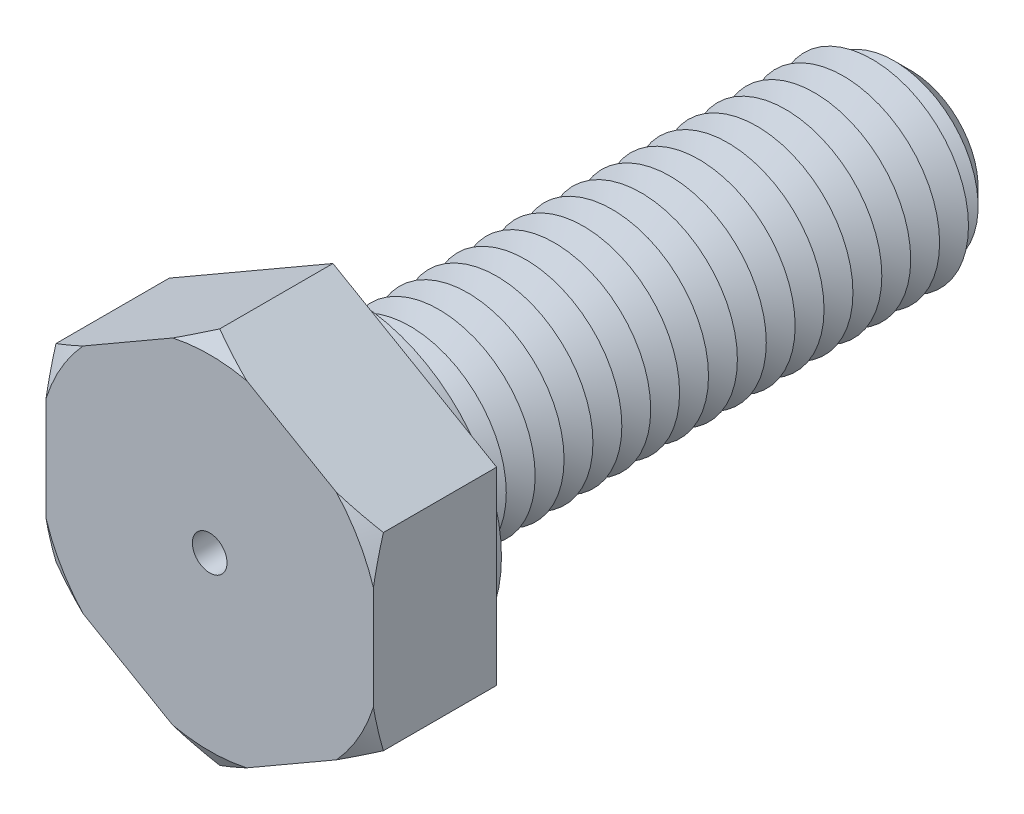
ISO-10303-21;
HEADER;
FILE_DESCRIPTION(('STEP AP214'),'2;1');
FILE_NAME('part.step','',(''),(''),'','','');
FILE_SCHEMA(('AUTOMOTIVE_DESIGN { 1 0 10303 214 1 1 1 1 }'));
ENDSEC;
DATA;
#1=APPLICATION_CONTEXT('core data for automotive mechanical design processes');
#2=APPLICATION_PROTOCOL_DEFINITION('international standard','automotive_design',2000,#1);
#3=PRODUCT_CONTEXT('',#1,'mechanical');
#4=PRODUCT('Part','Part','',(#3));
#5=PRODUCT_RELATED_PRODUCT_CATEGORY('part','',(#4));
#6=PRODUCT_DEFINITION_FORMATION('','',#4);
#7=PRODUCT_DEFINITION_CONTEXT('part definition',#1,'design');
#8=PRODUCT_DEFINITION('design','',#6,#7);
#9=PRODUCT_DEFINITION_SHAPE('','',#8);
#10=(LENGTH_UNIT() NAMED_UNIT(*) SI_UNIT(.MILLI.,.METRE.));
#11=(NAMED_UNIT(*) PLANE_ANGLE_UNIT() SI_UNIT($,.RADIAN.));
#12=(NAMED_UNIT(*) SI_UNIT($,.STERADIAN.) SOLID_ANGLE_UNIT());
#13=UNCERTAINTY_MEASURE_WITH_UNIT(LENGTH_MEASURE(1.E-05),#10,'distance_accuracy_value','');
#14=(GEOMETRIC_REPRESENTATION_CONTEXT(3) GLOBAL_UNCERTAINTY_ASSIGNED_CONTEXT((#13)) GLOBAL_UNIT_ASSIGNED_CONTEXT((#10,
#11,#12)) REPRESENTATION_CONTEXT('',''));
#15=CARTESIAN_POINT('',(0.,0.,0.));
#16=DIRECTION('',(0.,0.,1.));
#17=DIRECTION('',(1.,0.,0.));
#18=AXIS2_PLACEMENT_3D('',#15,#16,#17);
#19=CARTESIAN_POINT('',(8.5,4.90747728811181,6.4));
#20=DIRECTION('',(-0.5,-0.866025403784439,0.));
#21=DIRECTION('',(0.866025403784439,-0.5,0.));
#22=AXIS2_PLACEMENT_3D('',#19,#20,#21);
#23=PLANE('',#22);
#24=CARTESIAN_POINT('',(14.3974196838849,1.50260044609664,3.18954977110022));
#25=CARTESIAN_POINT('',(14.1303849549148,1.65677301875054,3.33361874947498));
#26=CARTESIAN_POINT('',(13.8627107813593,1.81131477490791,3.47613168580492));
#27=CARTESIAN_POINT('',(13.3258139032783,2.12129233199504,3.75731467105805));
#28=CARTESIAN_POINT('',(13.0565910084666,2.27672824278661,3.89598423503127));
#29=CARTESIAN_POINT('',(12.5155257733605,2.58911240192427,4.16915145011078));
#30=CARTESIAN_POINT('',(12.2436777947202,2.74606390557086,4.30363425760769));
#31=CARTESIAN_POINT('',(11.697943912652,3.06114350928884,4.56695627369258));
#32=CARTESIAN_POINT('',(11.4240580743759,3.21927157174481,4.69579566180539));
#33=CARTESIAN_POINT('',(10.8669438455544,3.54092162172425,4.94977636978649));
#34=CARTESIAN_POINT('',(10.5836547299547,3.70447866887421,5.07474091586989));
#35=CARTESIAN_POINT('',(10.0142178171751,4.03324322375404,5.31575754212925));
#36=CARTESIAN_POINT('',(9.72806988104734,4.19845081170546,5.43180918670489));
#37=CARTESIAN_POINT('',(9.15284957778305,4.53055440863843,5.6527883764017));
#38=CARTESIAN_POINT('',(8.86378033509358,4.69744861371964,5.75772666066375));
#39=CARTESIAN_POINT('',(8.28224800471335,5.03319646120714,5.95405449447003));
#40=CARTESIAN_POINT('',(7.98978536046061,5.20204984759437,6.04544579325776));
#41=CARTESIAN_POINT('',(7.29029341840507,5.60590170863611,6.24311258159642));
#42=CARTESIAN_POINT('',(6.88163396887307,5.84184135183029,6.34201308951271));
#43=CARTESIAN_POINT('',(6.2644717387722,6.1981601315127,6.46082851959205));
#44=CARTESIAN_POINT('',(6.05806549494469,6.31732883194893,6.49551015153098));
#45=CARTESIAN_POINT('',(5.64409758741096,6.55633331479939,6.55416143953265));
#46=CARTESIAN_POINT('',(5.43653593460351,6.67616909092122,6.57813119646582));
#47=CARTESIAN_POINT('',(5.02306823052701,6.914884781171,6.6144556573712));
#48=CARTESIAN_POINT('',(4.81717088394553,7.03375966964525,6.62694180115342));
#49=CARTESIAN_POINT('',(4.40509314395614,7.27167286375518,6.64040244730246));
#50=CARTESIAN_POINT('',(4.19891275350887,7.39071116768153,6.64137706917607));
#51=CARTESIAN_POINT('',(3.78675559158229,7.62867021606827,6.63178359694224));
#52=CARTESIAN_POINT('',(3.58077881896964,7.747590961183,6.62121556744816));
#53=CARTESIAN_POINT('',(3.16946579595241,7.9850626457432,6.58885652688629));
#54=CARTESIAN_POINT('',(2.96412965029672,8.10361352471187,6.56706376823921));
#55=CARTESIAN_POINT('',(2.47890311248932,8.38375919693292,6.50285520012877));
#56=CARTESIAN_POINT('',(2.19947000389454,8.54508997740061,6.45579627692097));
#57=CARTESIAN_POINT('',(1.6432817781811,8.86620539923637,6.34397240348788));
#58=CARTESIAN_POINT('',(1.36652705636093,9.02598981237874,6.27920487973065));
#59=CARTESIAN_POINT('',(0.815728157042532,9.34399370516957,6.13440902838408));
#60=CARTESIAN_POINT('',(0.541687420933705,9.50221119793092,6.05436342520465));
#61=CARTESIAN_POINT('',(-0.00331670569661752,9.81686947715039,5.88153285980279));
#62=CARTESIAN_POINT('',(-0.274280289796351,9.97331037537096,5.788748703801));
#63=CARTESIAN_POINT('',(-0.816522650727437,10.2863741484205,5.59147835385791));
#64=CARTESIAN_POINT('',(-1.08776675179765,10.4429770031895,5.48686595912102));
#65=CARTESIAN_POINT('',(-1.62738149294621,10.7545237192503,5.26886764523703));
#66=CARTESIAN_POINT('',(-1.89575390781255,10.9094686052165,5.15548754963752));
#67=CARTESIAN_POINT('',(-2.43005320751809,11.2179464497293,4.92150983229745));
#68=CARTESIAN_POINT('',(-2.69598059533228,11.3714796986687,4.80091373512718));
#69=CARTESIAN_POINT('',(-3.22575115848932,11.6773428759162,4.55376737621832));
#70=CARTESIAN_POINT('',(-3.48959429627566,11.829672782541,4.42721700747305));
#71=CARTESIAN_POINT('',(-3.9337259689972,12.0860923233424,4.20929972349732));
#72=CARTESIAN_POINT('',(-4.11449197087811,12.1904576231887,4.11922480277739));
#73=CARTESIAN_POINT('',(-4.47523725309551,12.3987340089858,3.93701701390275));
#74=CARTESIAN_POINT('',(-4.6552165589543,12.5026451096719,3.84488421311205));
#75=CARTESIAN_POINT('',(-5.01258669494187,12.7089728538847,3.65977671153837));
#76=CARTESIAN_POINT('',(-5.18998489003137,12.8113937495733,3.56682094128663));
#77=CARTESIAN_POINT('',(-5.54415606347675,13.0158745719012,3.3793246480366));
#78=CARTESIAN_POINT('',(-5.72092903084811,13.1179344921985,3.28478409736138));
#79=CARTESIAN_POINT('',(-5.89741968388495,13.2198314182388,3.18954977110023));
#80=B_SPLINE_CURVE_WITH_KNOTS('',3,(#24,#25,#26,#27,#28,#29,#30,#31,#32,#33,#34,#35,#36,#37,#38,
#39,#40,#41,#42,#43,#44,#45,#46,#47,#48,#49,#50,#51,#52,#53,#54,#55,#56,#57,#58,#59,#60,#61,#62,
#63,#64,#65,#66,#67,#68,#69,#70,#71,#72,#73,#74,#75,#76,#77,#78,#79),.UNSPECIFIED.,.F.,.F.,(4,2,
2,2,2,2,2,2,2,2,2,2,2,2,2,2,2,2,2,2,2,2,2,2,2,2,2,4),(0.,1.02103660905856,2.04220146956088,
3.06664888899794,4.09106369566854,5.1414707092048,6.19192902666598,7.24136281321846,
8.29066097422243,9.73548564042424,10.45782862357,11.1801648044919,11.8941264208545,
12.6080806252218,13.3220308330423,14.036092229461,15.0137259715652,15.9915018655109,
16.9703899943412,17.9492161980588,18.939699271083,19.9295300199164,20.9191523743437,
21.9087925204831,22.5907917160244,23.272768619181,23.947601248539,24.622445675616),.UNSPECIFIED.);
#81=CARTESIAN_POINT('',(8.5,4.90747728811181,5.88038475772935));
#82=VERTEX_POINT('',#81);
#83=CARTESIAN_POINT('',(6.57804882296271,6.01711631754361,6.4));
#84=VERTEX_POINT('',#83);
#85=EDGE_CURVE('E132',#82,#84,#80,.T.);
#86=ORIENTED_EDGE('',*,*,#85,.F.);
#87=DIRECTION('',(0.,0.,-1.));
#88=VECTOR('',#87,1.);
#89=CARTESIAN_POINT('',(8.5,4.90747728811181,6.4));
#90=LINE('',#89,#88);
#91=CARTESIAN_POINT('',(8.5,4.90747728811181,0.));
#92=VERTEX_POINT('',#91);
#93=EDGE_CURVE('E144',#82,#92,#90,.T.);
#94=ORIENTED_EDGE('',*,*,#93,.T.);
#95=DIRECTION('',(-0.866025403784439,0.5,0.));
#96=VECTOR('',#95,1.);
#97=CARTESIAN_POINT('',(8.5,4.90747728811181,0.));
#98=LINE('',#97,#96);
#99=CARTESIAN_POINT('',(0.,9.81495457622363,0.));
#100=VERTEX_POINT('',#99);
#101=EDGE_CURVE('E354',#92,#100,#98,.T.);
#102=ORIENTED_EDGE('',*,*,#101,.T.);
#103=DIRECTION('',(0.,0.,-1.));
#104=VECTOR('',#103,1.);
#105=CARTESIAN_POINT('',(0.,9.81495457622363,6.4));
#106=LINE('',#105,#104);
#107=CARTESIAN_POINT('',(0.,9.81495457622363,5.88038475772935));
#108=VERTEX_POINT('',#107);
#109=EDGE_CURVE('E179',#108,#100,#106,.T.);
#110=ORIENTED_EDGE('',*,*,#109,.F.);
#111=CARTESIAN_POINT('',(1.92195117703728,8.70531554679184,6.4));
#112=VERTEX_POINT('',#111);
#113=EDGE_CURVE('E151',#112,#108,#80,.T.);
#114=ORIENTED_EDGE('',*,*,#113,.F.);
#115=DIRECTION('',(-0.866025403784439,0.5,0.));
#116=VECTOR('',#115,1.);
#117=CARTESIAN_POINT('',(8.5,4.90747728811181,6.4));
#118=LINE('',#117,#116);
#119=EDGE_CURVE('E148',#84,#112,#118,.T.);
#120=ORIENTED_EDGE('',*,*,#119,.F.);
#121=EDGE_LOOP('',(#86,#94,#102,#110,#114,#120));
#122=FACE_BOUND('',#121,.T.);
#123=ADVANCED_FACE('F39',(#122),#23,.F.);
#124=CARTESIAN_POINT('',(0.,9.81495457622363,6.4));
#125=DIRECTION('',(0.5,-0.866025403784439,0.));
#126=DIRECTION('',(0.866025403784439,0.5,0.));
#127=AXIS2_PLACEMENT_3D('',#124,#125,#126);
#128=PLANE('',#127);
#129=CARTESIAN_POINT('',(5.89741968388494,13.2198314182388,3.18954977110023));
#130=CARTESIAN_POINT('',(5.63038495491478,13.0656588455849,3.33361874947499));
#131=CARTESIAN_POINT('',(5.36271078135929,12.9111170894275,3.47613168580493));
#132=CARTESIAN_POINT('',(4.82581390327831,12.6011395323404,3.75731467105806));
#133=CARTESIAN_POINT('',(4.55659100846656,12.4457036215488,3.89598423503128));
#134=CARTESIAN_POINT('',(4.01552577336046,12.1333194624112,4.16915145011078));
#135=CARTESIAN_POINT('',(3.74367779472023,11.9763679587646,4.30363425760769));
#136=CARTESIAN_POINT('',(3.19794391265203,11.6612883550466,4.56695627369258));
#137=CARTESIAN_POINT('',(2.92405807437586,11.5031602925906,4.69579566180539));
#138=CARTESIAN_POINT('',(2.3669438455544,11.1815102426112,4.9497763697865));
#139=CARTESIAN_POINT('',(2.08365472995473,11.0179531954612,5.0747409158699));
#140=CARTESIAN_POINT('',(1.51421781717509,10.6891886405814,5.31575754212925));
#141=CARTESIAN_POINT('',(1.22806988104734,10.52398105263,5.4318091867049));
#142=CARTESIAN_POINT('',(0.652849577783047,10.191877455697,5.6527883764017));
#143=CARTESIAN_POINT('',(0.363780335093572,10.0249832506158,5.75772666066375));
#144=CARTESIAN_POINT('',(-0.21775199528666,9.6892354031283,5.95405449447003));
#145=CARTESIAN_POINT('',(-0.510214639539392,9.52038201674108,6.04544579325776));
#146=CARTESIAN_POINT('',(-1.20970658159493,9.11653015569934,6.24311258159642));
#147=CARTESIAN_POINT('',(-1.61836603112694,8.88059051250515,6.34201308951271));
#148=CARTESIAN_POINT('',(-2.2355282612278,8.52427173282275,6.46082851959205));
#149=CARTESIAN_POINT('',(-2.44193450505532,8.40510303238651,6.49551015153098));
#150=CARTESIAN_POINT('',(-2.85590241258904,8.16609854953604,6.55416143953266));
#151=CARTESIAN_POINT('',(-3.0634640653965,8.04626277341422,6.57813119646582));
#152=CARTESIAN_POINT('',(-3.47693176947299,7.80754708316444,6.6144556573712));
#153=CARTESIAN_POINT('',(-3.68282911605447,7.68867219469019,6.62694180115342));
#154=CARTESIAN_POINT('',(-4.09490685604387,7.45075900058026,6.64040244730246));
#155=CARTESIAN_POINT('',(-4.30108724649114,7.33172069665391,6.64137706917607));
#156=CARTESIAN_POINT('',(-4.71324440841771,7.09376164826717,6.63178359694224));
#157=CARTESIAN_POINT('',(-4.91922118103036,6.97484090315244,6.62121556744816));
#158=CARTESIAN_POINT('',(-5.3305342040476,6.73736921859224,6.58885652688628));
#159=CARTESIAN_POINT('',(-5.53587034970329,6.61881833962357,6.5670637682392));
#160=CARTESIAN_POINT('',(-6.02109688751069,6.33867266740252,6.50285520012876));
#161=CARTESIAN_POINT('',(-6.30052999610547,6.17734188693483,6.45579627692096));
#162=CARTESIAN_POINT('',(-6.85671822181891,5.85622646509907,6.34397240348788));
#163=CARTESIAN_POINT('',(-7.13347294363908,5.6964420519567,6.27920487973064));
#164=CARTESIAN_POINT('',(-7.68427184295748,5.37843815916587,6.13440902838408));
#165=CARTESIAN_POINT('',(-7.9583125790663,5.22022066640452,6.05436342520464));
#166=CARTESIAN_POINT('',(-8.50331670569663,4.90556238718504,5.88153285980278));
#167=CARTESIAN_POINT('',(-8.77428028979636,4.74912148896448,5.78874870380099));
#168=CARTESIAN_POINT('',(-9.31652265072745,4.4360577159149,5.59147835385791));
#169=CARTESIAN_POINT('',(-9.58776675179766,4.27945486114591,5.48686595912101));
#170=CARTESIAN_POINT('',(-10.1273814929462,3.9679081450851,5.26886764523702));
#171=CARTESIAN_POINT('',(-10.3957539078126,3.81296325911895,5.15548754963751));
#172=CARTESIAN_POINT('',(-10.9300532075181,3.50448541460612,4.92150983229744));
#173=CARTESIAN_POINT('',(-11.1959805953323,3.35095216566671,4.80091373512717));
#174=CARTESIAN_POINT('',(-11.7257511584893,3.04508898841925,4.55376737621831));
#175=CARTESIAN_POINT('',(-11.9895942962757,2.89275908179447,4.42721700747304));
#176=CARTESIAN_POINT('',(-12.4337259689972,2.63633954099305,4.20929972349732));
#177=CARTESIAN_POINT('',(-12.6144919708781,2.53197424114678,4.11922480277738));
#178=CARTESIAN_POINT('',(-12.9752372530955,2.32369785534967,3.93701701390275));
#179=CARTESIAN_POINT('',(-13.1552165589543,2.21978675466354,3.84488421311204));
#180=CARTESIAN_POINT('',(-13.5125866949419,2.01345901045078,3.65977671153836));
#181=CARTESIAN_POINT('',(-13.6899848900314,1.91103811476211,3.56682094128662));
#182=CARTESIAN_POINT('',(-14.0441560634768,1.70655729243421,3.37932464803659));
#183=CARTESIAN_POINT('',(-14.2209290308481,1.60449737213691,3.28478409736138));
#184=CARTESIAN_POINT('',(-14.3974196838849,1.50260044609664,3.18954977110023));
#185=B_SPLINE_CURVE_WITH_KNOTS('',3,(#129,#130,#131,#132,#133,#134,#135,#136,#137,#138,#139,
#140,#141,#142,#143,#144,#145,#146,#147,#148,#149,#150,#151,#152,#153,#154,#155,#156,#157,#158,
#159,#160,#161,#162,#163,#164,#165,#166,#167,#168,#169,#170,#171,#172,#173,#174,#175,#176,#177,
#178,#179,#180,#181,#182,#183,#184),.UNSPECIFIED.,.F.,.F.,(4,2,2,2,2,2,2,2,2,2,2,2,2,2,2,2,2,2,
2,2,2,2,2,2,2,2,2,4),(0.,1.02103660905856,2.04220146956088,3.06664888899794,4.09106369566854,
5.14147070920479,6.19192902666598,7.24136281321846,8.29066097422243,9.73548564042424,
10.45782862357,11.1801648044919,11.8941264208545,12.6080806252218,13.3220308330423,
14.036092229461,15.0137259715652,15.991501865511,16.9703899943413,17.9492161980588,
18.939699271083,19.9295300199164,20.9191523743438,21.9087925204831,22.5907917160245,
23.272768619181,23.947601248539,24.622445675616),.UNSPECIFIED.);
#186=CARTESIAN_POINT('',(-1.92195117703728,8.70531554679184,6.4));
#187=VERTEX_POINT('',#186);
#188=EDGE_CURVE('E476',#108,#187,#185,.T.);
#189=ORIENTED_EDGE('',*,*,#188,.F.);
#190=ORIENTED_EDGE('',*,*,#109,.T.);
#191=DIRECTION('',(-0.866025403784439,-0.5,0.));
#192=VECTOR('',#191,1.);
#193=CARTESIAN_POINT('',(0.,9.81495457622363,0.));
#194=LINE('',#193,#192);
#195=CARTESIAN_POINT('',(-8.5,4.90747728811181,0.));
#196=VERTEX_POINT('',#195);
#197=EDGE_CURVE('E373',#100,#196,#194,.T.);
#198=ORIENTED_EDGE('',*,*,#197,.T.);
#199=DIRECTION('',(0.,0.,-1.));
#200=VECTOR('',#199,1.);
#201=CARTESIAN_POINT('',(-8.5,4.90747728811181,6.4));
#202=LINE('',#201,#200);
#203=CARTESIAN_POINT('',(-8.5,4.90747728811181,5.88038475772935));
#204=VERTEX_POINT('',#203);
#205=EDGE_CURVE('E176',#204,#196,#202,.T.);
#206=ORIENTED_EDGE('',*,*,#205,.F.);
#207=CARTESIAN_POINT('',(-6.57804882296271,6.01711631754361,6.4));
#208=VERTEX_POINT('',#207);
#209=EDGE_CURVE('E402',#208,#204,#185,.T.);
#210=ORIENTED_EDGE('',*,*,#209,.F.);
#211=DIRECTION('',(-0.866025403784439,-0.5,0.));
#212=VECTOR('',#211,1.);
#213=CARTESIAN_POINT('',(0.,9.81495457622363,6.4));
#214=LINE('',#213,#212);
#215=EDGE_CURVE('E357',#187,#208,#214,.T.);
#216=ORIENTED_EDGE('',*,*,#215,.F.);
#217=EDGE_LOOP('',(#189,#190,#198,#206,#210,#216));
#218=FACE_BOUND('',#217,.T.);
#219=ADVANCED_FACE('F463',(#218),#128,.F.);
#220=CARTESIAN_POINT('',(-8.5,4.90747728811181,6.4));
#221=DIRECTION('',(1.,0.,0.));
#222=DIRECTION('',(0.,0.,-1.));
#223=AXIS2_PLACEMENT_3D('',#220,#221,#222);
#224=PLANE('',#223);
#225=CARTESIAN_POINT('',(-8.5,10.8048969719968,3.60988571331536));
#226=CARTESIAN_POINT('',(-8.5,10.4978348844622,3.74918346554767));
#227=CARTESIAN_POINT('',(-8.5,10.189932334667,3.88666386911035));
#228=CARTESIAN_POINT('',(-8.5,9.57208629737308,4.15710808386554));
#229=CARTESIAN_POINT('',(-8.5,9.26214245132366,4.29007107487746));
#230=CARTESIAN_POINT('',(-8.5,8.6386633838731,4.55109231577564));
#231=CARTESIAN_POINT('',(-8.5,8.32511856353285,4.67912772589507));
#232=CARTESIAN_POINT('',(-8.5,7.69537699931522,4.92848462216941));
#233=CARTESIAN_POINT('',(-8.5,7.37918037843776,5.04980641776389));
#234=CARTESIAN_POINT('',(-8.5,6.74517674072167,5.28371307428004));
#235=CARTESIAN_POINT('',(-8.5,6.42738342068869,5.39633487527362));
#236=CARTESIAN_POINT('',(-8.5,5.78839893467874,5.61161420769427));
#237=CARTESIAN_POINT('',(-8.5,5.46720760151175,5.7142712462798));
#238=CARTESIAN_POINT('',(-8.5,4.82159629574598,5.90726308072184));
#239=CARTESIAN_POINT('',(-8.5,4.49718135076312,5.99761456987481));
#240=CARTESIAN_POINT('',(-8.5,3.84456693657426,6.16359045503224));
#241=CARTESIAN_POINT('',(-8.5,3.51636763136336,6.23921548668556));
#242=CARTESIAN_POINT('',(-8.5,2.94974096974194,6.35404738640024));
#243=CARTESIAN_POINT('',(-8.5,2.7121746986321,6.39750509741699));
#244=CARTESIAN_POINT('',(-8.5,2.23545236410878,6.47441576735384));
#245=CARTESIAN_POINT('',(-8.5,1.99629657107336,6.50787038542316));
#246=CARTESIAN_POINT('',(-8.5,1.51674855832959,6.56389930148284));
#247=CARTESIAN_POINT('',(-8.5,1.27635657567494,6.58647561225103));
#248=CARTESIAN_POINT('',(-8.5,0.794760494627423,6.62010098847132));
#249=CARTESIAN_POINT('',(-8.5,0.553556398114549,6.63115008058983));
#250=CARTESIAN_POINT('',(-8.5,0.0710159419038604,6.64137634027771));
#251=CARTESIAN_POINT('',(-8.5,-0.170320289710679,6.64055949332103));
#252=CARTESIAN_POINT('',(-8.5,-0.65265778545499,6.62709447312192));
#253=CARTESIAN_POINT('',(-8.5,-0.893659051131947,6.6144463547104));
#254=CARTESIAN_POINT('',(-8.5,-1.37480632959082,6.57770491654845));
#255=CARTESIAN_POINT('',(-8.5,-1.61495224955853,6.55361039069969));
#256=CARTESIAN_POINT('',(-8.5,-2.09391419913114,6.49466927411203));
#257=CARTESIAN_POINT('',(-8.5,-2.33273017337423,6.4598222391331));
#258=CARTESIAN_POINT('',(-8.5,-2.92716537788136,6.36046793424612));
#259=CARTESIAN_POINT('',(-8.5,-3.28176466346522,6.28983043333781));
#260=CARTESIAN_POINT('',(-8.5,-3.98672843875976,6.12983266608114));
#261=CARTESIAN_POINT('',(-8.5,-4.3370917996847,6.0404675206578));
#262=CARTESIAN_POINT('',(-8.5,-5.0342542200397,5.84616571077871));
#263=CARTESIAN_POINT('',(-8.5,-5.3810438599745,5.74119557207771));
#264=CARTESIAN_POINT('',(-8.5,-6.07054103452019,5.51879279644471));
#265=CARTESIAN_POINT('',(-8.5,-6.41324885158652,5.40136102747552));
#266=CARTESIAN_POINT('',(-8.5,-7.09891821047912,5.15508322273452));
#267=CARTESIAN_POINT('',(-8.5,-7.44183833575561,5.02612259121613));
#268=CARTESIAN_POINT('',(-8.5,-8.12447486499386,4.75996128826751));
#269=CARTESIAN_POINT('',(-8.5,-8.46419106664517,4.62276010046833));
#270=CARTESIAN_POINT('',(-8.5,-9.13876623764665,4.34260011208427));
#271=CARTESIAN_POINT('',(-8.5,-9.47364225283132,4.19968216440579));
#272=CARTESIAN_POINT('',(-8.5,-10.1409696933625,3.90850505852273));
#273=CARTESIAN_POINT('',(-8.5,-10.4734216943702,3.76024722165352));
#274=CARTESIAN_POINT('',(-8.5,-10.8048969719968,3.60988571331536));
#275=B_SPLINE_CURVE_WITH_KNOTS('',3,(#225,#226,#227,#228,#229,#230,#231,#232,#233,#234,#235,
#236,#237,#238,#239,#240,#241,#242,#243,#244,#245,#246,#247,#248,#249,#250,#251,#252,#253,#254,
#255,#256,#257,#258,#259,#260,#261,#262,#263,#264,#265,#266,#267,#268,#269,#270,#271,#272,#273,
#274),.UNSPECIFIED.,.F.,.F.,(4,2,2,2,2,2,2,2,2,2,2,2,2,2,2,2,2,2,2,2,2,2,2,2,4),(0.,
1.01155870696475,2.02330010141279,3.03927305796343,4.05519914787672,5.06654285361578,
6.07793655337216,7.08794426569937,8.09790837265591,8.82224854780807,9.5464685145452,
10.2705544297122,10.9946386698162,11.7183576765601,12.4420733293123,13.1658652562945,
13.8896870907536,14.9737367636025,16.0580692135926,17.1447621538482,18.2313794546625,
19.3303511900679,20.4293918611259,21.5216359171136,22.6136115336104),.UNSPECIFIED.);
#276=CARTESIAN_POINT('',(-8.5,2.68819922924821,6.4));
#277=VERTEX_POINT('',#276);
#278=EDGE_CURVE('E395',#204,#277,#275,.T.);
#279=ORIENTED_EDGE('',*,*,#278,.F.);
#280=ORIENTED_EDGE('',*,*,#205,.T.);
#281=DIRECTION('',(0.,-1.,0.));
#282=VECTOR('',#281,1.);
#283=CARTESIAN_POINT('',(-8.5,4.90747728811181,0.));
#284=LINE('',#283,#282);
#285=CARTESIAN_POINT('',(-8.5,-4.90747728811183,0.));
#286=VERTEX_POINT('',#285);
#287=EDGE_CURVE('E376',#196,#286,#284,.T.);
#288=ORIENTED_EDGE('',*,*,#287,.T.);
#289=DIRECTION('',(0.,0.,-1.));
#290=VECTOR('',#289,1.);
#291=CARTESIAN_POINT('',(-8.5,-4.90747728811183,6.4));
#292=LINE('',#291,#290);
#293=CARTESIAN_POINT('',(-8.49999999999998,-4.90747728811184,5.88038475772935));
#294=VERTEX_POINT('',#293);
#295=EDGE_CURVE('E173',#294,#286,#292,.T.);
#296=ORIENTED_EDGE('',*,*,#295,.F.);
#297=CARTESIAN_POINT('',(-8.5,-2.68819922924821,6.4));
#298=VERTEX_POINT('',#297);
#299=EDGE_CURVE('E394',#298,#294,#275,.T.);
#300=ORIENTED_EDGE('',*,*,#299,.F.);
#301=DIRECTION('',(0.,-1.,0.));
#302=VECTOR('',#301,1.);
#303=CARTESIAN_POINT('',(-8.5,4.90747728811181,6.4));
#304=LINE('',#303,#302);
#305=EDGE_CURVE('E361',#277,#298,#304,.T.);
#306=ORIENTED_EDGE('',*,*,#305,.F.);
#307=EDGE_LOOP('',(#279,#280,#288,#296,#300,#306));
#308=FACE_BOUND('',#307,.T.);
#309=ADVANCED_FACE('F420',(#308),#224,.F.);
#310=CARTESIAN_POINT('',(-8.5,-4.90747728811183,6.4));
#311=DIRECTION('',(0.5,0.866025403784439,0.));
#312=DIRECTION('',(-0.866025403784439,0.5,0.));
#313=AXIS2_PLACEMENT_3D('',#310,#311,#312);
#314=PLANE('',#313);
#315=CARTESIAN_POINT('',(-14.3974196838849,-1.50260044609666,3.18954977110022));
#316=CARTESIAN_POINT('',(-14.1303849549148,-1.65677301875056,3.33361874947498));
#317=CARTESIAN_POINT('',(-13.8627107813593,-1.81131477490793,3.47613168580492));
#318=CARTESIAN_POINT('',(-13.3258139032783,-2.12129233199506,3.75731467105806));
#319=CARTESIAN_POINT('',(-13.0565910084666,-2.27672824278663,3.89598423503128));
#320=CARTESIAN_POINT('',(-12.5155257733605,-2.58911240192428,4.16915145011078));
#321=CARTESIAN_POINT('',(-12.2436777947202,-2.74606390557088,4.30363425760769));
#322=CARTESIAN_POINT('',(-11.697943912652,-3.06114350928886,4.56695627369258));
#323=CARTESIAN_POINT('',(-11.4240580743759,-3.21927157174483,4.69579566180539));
#324=CARTESIAN_POINT('',(-10.8669438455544,-3.54092162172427,4.94977636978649));
#325=CARTESIAN_POINT('',(-10.5836547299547,-3.70447866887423,5.07474091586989));
#326=CARTESIAN_POINT('',(-10.0142178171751,-4.03324322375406,5.31575754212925));
#327=CARTESIAN_POINT('',(-9.72806988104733,-4.19845081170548,5.43180918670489));
#328=CARTESIAN_POINT('',(-9.15284957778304,-4.53055440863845,5.65278837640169));
#329=CARTESIAN_POINT('',(-8.86378033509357,-4.69744861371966,5.75772666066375));
#330=CARTESIAN_POINT('',(-8.28224800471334,-5.03319646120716,5.95405449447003));
#331=CARTESIAN_POINT('',(-7.9897853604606,-5.20204984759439,6.04544579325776));
#332=CARTESIAN_POINT('',(-7.29029341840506,-5.60590170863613,6.24311258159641));
#333=CARTESIAN_POINT('',(-6.88163396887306,-5.84184135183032,6.34201308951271));
#334=CARTESIAN_POINT('',(-6.26447173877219,-6.19816013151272,6.46082851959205));
#335=CARTESIAN_POINT('',(-6.05806549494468,-6.31732883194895,6.49551015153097));
#336=CARTESIAN_POINT('',(-5.64409758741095,-6.55633331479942,6.55416143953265));
#337=CARTESIAN_POINT('',(-5.4365359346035,-6.67616909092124,6.57813119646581));
#338=CARTESIAN_POINT('',(-5.023068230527,-6.91488478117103,6.6144556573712));
#339=CARTESIAN_POINT('',(-4.81717088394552,-7.03375966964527,6.62694180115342));
#340=CARTESIAN_POINT('',(-4.40509314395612,-7.2716728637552,6.64040244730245));
#341=CARTESIAN_POINT('',(-4.19891275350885,-7.39071116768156,6.64137706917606));
#342=CARTESIAN_POINT('',(-3.78675559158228,-7.6286702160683,6.63178359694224));
#343=CARTESIAN_POINT('',(-3.58077881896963,-7.74759096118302,6.62121556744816));
#344=CARTESIAN_POINT('',(-3.16946579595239,-7.98506264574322,6.58885652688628));
#345=CARTESIAN_POINT('',(-2.9641296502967,-8.10361352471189,6.5670637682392));
#346=CARTESIAN_POINT('',(-2.4789031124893,-8.38375919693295,6.50285520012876));
#347=CARTESIAN_POINT('',(-2.19947000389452,-8.54508997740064,6.45579627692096));
#348=CARTESIAN_POINT('',(-1.64328177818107,-8.8662053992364,6.34397240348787));
#349=CARTESIAN_POINT('',(-1.36652705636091,-9.02598981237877,6.27920487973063));
#350=CARTESIAN_POINT('',(-0.815728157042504,-9.3439937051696,6.13440902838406));
#351=CARTESIAN_POINT('',(-0.541687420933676,-9.50221119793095,6.05436342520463));
#352=CARTESIAN_POINT('',(0.00331670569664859,-9.81686947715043,5.88153285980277));
#353=CARTESIAN_POINT('',(0.274280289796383,-9.973310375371,5.78874870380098));
#354=CARTESIAN_POINT('',(0.81652265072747,-10.2863741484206,5.59147835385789));
#355=CARTESIAN_POINT('',(1.08776675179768,-10.4429770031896,5.486865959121));
#356=CARTESIAN_POINT('',(1.62738149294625,-10.7545237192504,5.268867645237));
#357=CARTESIAN_POINT('',(1.89575390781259,-10.9094686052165,5.15548754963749));
#358=CARTESIAN_POINT('',(2.43005320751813,-11.2179464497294,4.92150983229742));
#359=CARTESIAN_POINT('',(2.69598059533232,-11.3714796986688,4.80091373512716));
#360=CARTESIAN_POINT('',(3.22575115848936,-11.6773428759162,4.55376737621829));
#361=CARTESIAN_POINT('',(3.48959429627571,-11.829672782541,4.42721700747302));
#362=CARTESIAN_POINT('',(3.93372596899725,-12.0860923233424,4.20929972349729));
#363=CARTESIAN_POINT('',(4.11449197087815,-12.1904576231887,4.11922480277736));
#364=CARTESIAN_POINT('',(4.47523725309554,-12.3987340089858,3.93701701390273));
#365=CARTESIAN_POINT('',(4.65521655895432,-12.5026451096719,3.84488421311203));
#366=CARTESIAN_POINT('',(5.01258669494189,-12.7089728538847,3.65977671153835));
#367=CARTESIAN_POINT('',(5.18998489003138,-12.8113937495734,3.56682094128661));
#368=CARTESIAN_POINT('',(5.54415606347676,-13.0158745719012,3.37932464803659));
#369=CARTESIAN_POINT('',(5.72092903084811,-13.1179344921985,3.28478409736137));
#370=CARTESIAN_POINT('',(5.89741968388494,-13.2198314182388,3.18954977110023));
#371=B_SPLINE_CURVE_WITH_KNOTS('',3,(#315,#316,#317,#318,#319,#320,#321,#322,#323,#324,#325,
#326,#327,#328,#329,#330,#331,#332,#333,#334,#335,#336,#337,#338,#339,#340,#341,#342,#343,#344,
#345,#346,#347,#348,#349,#350,#351,#352,#353,#354,#355,#356,#357,#358,#359,#360,#361,#362,#363,
#364,#365,#366,#367,#368,#369,#370),.UNSPECIFIED.,.F.,.F.,(4,2,2,2,2,2,2,2,2,2,2,2,2,2,2,2,2,2,
2,2,2,2,2,2,2,2,2,4),(0.,1.02103660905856,2.04220146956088,3.06664888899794,4.09106369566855,
5.1414707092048,6.19192902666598,7.24136281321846,8.29066097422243,9.73548564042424,
10.45782862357,11.1801648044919,11.8941264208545,12.6080806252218,13.3220308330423,
14.036092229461,15.0137259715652,15.991501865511,16.9703899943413,17.9492161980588,
18.939699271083,19.9295300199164,20.9191523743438,21.9087925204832,22.5907917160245,
23.272768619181,23.947601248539,24.622445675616),.UNSPECIFIED.);
#372=CARTESIAN_POINT('',(-6.57804882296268,-6.01711631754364,6.4));
#373=VERTEX_POINT('',#372);
#374=EDGE_CURVE('E396',#294,#373,#371,.T.);
#375=ORIENTED_EDGE('',*,*,#374,.F.);
#376=ORIENTED_EDGE('',*,*,#295,.T.);
#377=DIRECTION('',(0.866025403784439,-0.5,0.));
#378=VECTOR('',#377,1.);
#379=CARTESIAN_POINT('',(-8.5,-4.90747728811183,0.));
#380=LINE('',#379,#378);
#381=CARTESIAN_POINT('',(0.,-9.81495457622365,0.));
#382=VERTEX_POINT('',#381);
#383=EDGE_CURVE('E380',#286,#382,#380,.T.);
#384=ORIENTED_EDGE('',*,*,#383,.T.);
#385=DIRECTION('',(0.,0.,-1.));
#386=VECTOR('',#385,1.);
#387=CARTESIAN_POINT('',(0.,-9.81495457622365,6.4));
#388=LINE('',#387,#386);
#389=CARTESIAN_POINT('',(0.,-9.81495457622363,5.88038475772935));
#390=VERTEX_POINT('',#389);
#391=EDGE_CURVE('E163',#390,#382,#388,.T.);
#392=ORIENTED_EDGE('',*,*,#391,.F.);
#393=CARTESIAN_POINT('',(-1.92195117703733,-8.70531554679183,6.4));
#394=VERTEX_POINT('',#393);
#395=EDGE_CURVE('E404',#394,#390,#371,.T.);
#396=ORIENTED_EDGE('',*,*,#395,.F.);
#397=DIRECTION('',(0.866025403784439,-0.5,0.));
#398=VECTOR('',#397,1.);
#399=CARTESIAN_POINT('',(-8.5,-4.90747728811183,6.4));
#400=LINE('',#399,#398);
#401=EDGE_CURVE('E364',#373,#394,#400,.T.);
#402=ORIENTED_EDGE('',*,*,#401,.F.);
#403=EDGE_LOOP('',(#375,#376,#384,#392,#396,#402));
#404=FACE_BOUND('',#403,.T.);
#405=ADVANCED_FACE('F454',(#404),#314,.F.);
#406=CARTESIAN_POINT('',(0.,-9.81495457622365,6.4));
#407=DIRECTION('',(-0.5,0.866025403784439,0.));
#408=DIRECTION('',(-0.866025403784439,-0.5,0.));
#409=AXIS2_PLACEMENT_3D('',#406,#407,#408);
#410=PLANE('',#409);
#411=CARTESIAN_POINT('',(-5.89741968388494,-13.2198314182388,3.18954977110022));
#412=CARTESIAN_POINT('',(-5.63038495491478,-13.0656588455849,3.33361874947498));
#413=CARTESIAN_POINT('',(-5.36271078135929,-12.9111170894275,3.47613168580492));
#414=CARTESIAN_POINT('',(-4.8258139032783,-12.6011395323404,3.75731467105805));
#415=CARTESIAN_POINT('',(-4.55659100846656,-12.4457036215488,3.89598423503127));
#416=CARTESIAN_POINT('',(-4.01552577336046,-12.1333194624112,4.16915145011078));
#417=CARTESIAN_POINT('',(-3.74367779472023,-11.9763679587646,4.30363425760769));
#418=CARTESIAN_POINT('',(-3.19794391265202,-11.6612883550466,4.56695627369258));
#419=CARTESIAN_POINT('',(-2.92405807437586,-11.5031602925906,4.69579566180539));
#420=CARTESIAN_POINT('',(-2.36694384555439,-11.1815102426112,4.94977636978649));
#421=CARTESIAN_POINT('',(-2.08365472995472,-11.0179531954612,5.07474091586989));
#422=CARTESIAN_POINT('',(-1.51421781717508,-10.6891886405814,5.31575754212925));
#423=CARTESIAN_POINT('',(-1.22806988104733,-10.52398105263,5.43180918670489));
#424=CARTESIAN_POINT('',(-0.652849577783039,-10.191877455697,5.65278837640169));
#425=CARTESIAN_POINT('',(-0.363780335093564,-10.0249832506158,5.75772666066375));
#426=CARTESIAN_POINT('',(0.217751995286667,-9.68923540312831,5.95405449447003));
#427=CARTESIAN_POINT('',(0.5102146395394,-9.52038201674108,6.04544579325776));
#428=CARTESIAN_POINT('',(1.20970658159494,-9.11653015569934,6.24311258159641));
#429=CARTESIAN_POINT('',(1.61836603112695,-8.88059051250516,6.34201308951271));
#430=CARTESIAN_POINT('',(2.23552826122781,-8.52427173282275,6.46082851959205));
#431=CARTESIAN_POINT('',(2.44193450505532,-8.40510303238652,6.49551015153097));
#432=CARTESIAN_POINT('',(2.85590241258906,-8.16609854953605,6.55416143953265));
#433=CARTESIAN_POINT('',(3.06346406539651,-8.04626277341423,6.57813119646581));
#434=CARTESIAN_POINT('',(3.47693176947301,-7.80754708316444,6.61445565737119));
#435=CARTESIAN_POINT('',(3.68282911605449,-7.6886721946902,6.62694180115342));
#436=CARTESIAN_POINT('',(4.09490685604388,-7.45075900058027,6.64040244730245));
#437=CARTESIAN_POINT('',(4.30108724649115,-7.33172069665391,6.64137706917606));
#438=CARTESIAN_POINT('',(4.71324440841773,-7.09376164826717,6.63178359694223));
#439=CARTESIAN_POINT('',(4.91922118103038,-6.97484090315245,6.62121556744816));
#440=CARTESIAN_POINT('',(5.33053420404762,-6.73736921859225,6.58885652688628));
#441=CARTESIAN_POINT('',(5.5358703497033,-6.61881833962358,6.5670637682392));
#442=CARTESIAN_POINT('',(6.02109688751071,-6.33867266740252,6.50285520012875));
#443=CARTESIAN_POINT('',(6.30052999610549,-6.17734188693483,6.45579627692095));
#444=CARTESIAN_POINT('',(6.85671822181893,-5.85622646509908,6.34397240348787));
#445=CARTESIAN_POINT('',(7.1334729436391,-5.6964420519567,6.27920487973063));
#446=CARTESIAN_POINT('',(7.6842718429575,-5.37843815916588,6.13440902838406));
#447=CARTESIAN_POINT('',(7.95831257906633,-5.22022066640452,6.05436342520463));
#448=CARTESIAN_POINT('',(8.50331670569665,-4.90556238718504,5.88153285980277));
#449=CARTESIAN_POINT('',(8.77428028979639,-4.74912148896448,5.78874870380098));
#450=CARTESIAN_POINT('',(9.31652265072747,-4.4360577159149,5.59147835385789));
#451=CARTESIAN_POINT('',(9.58776675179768,-4.27945486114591,5.486865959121));
#452=CARTESIAN_POINT('',(10.1273814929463,-3.9679081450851,5.268867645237));
#453=CARTESIAN_POINT('',(10.3957539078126,-3.81296325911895,5.15548754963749));
#454=CARTESIAN_POINT('',(10.9300532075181,-3.50448541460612,4.92150983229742));
#455=CARTESIAN_POINT('',(11.1959805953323,-3.35095216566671,4.80091373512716));
#456=CARTESIAN_POINT('',(11.7257511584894,-3.04508898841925,4.5537673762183));
#457=CARTESIAN_POINT('',(11.9895942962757,-2.89275908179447,4.42721700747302));
#458=CARTESIAN_POINT('',(12.4337259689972,-2.63633954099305,4.20929972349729));
#459=CARTESIAN_POINT('',(12.6144919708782,-2.53197424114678,4.11922480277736));
#460=CARTESIAN_POINT('',(12.9752372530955,-2.32369785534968,3.93701701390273));
#461=CARTESIAN_POINT('',(13.1552165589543,-2.21978675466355,3.84488421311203));
#462=CARTESIAN_POINT('',(13.5125866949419,-2.0134590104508,3.65977671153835));
#463=CARTESIAN_POINT('',(13.6899848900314,-1.91103811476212,3.56682094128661));
#464=CARTESIAN_POINT('',(14.0441560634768,-1.70655729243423,3.37932464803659));
#465=CARTESIAN_POINT('',(14.2209290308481,-1.60449737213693,3.28478409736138));
#466=CARTESIAN_POINT('',(14.3974196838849,-1.50260044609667,3.18954977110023));
#467=B_SPLINE_CURVE_WITH_KNOTS('',3,(#411,#412,#413,#414,#415,#416,#417,#418,#419,#420,#421,
#422,#423,#424,#425,#426,#427,#428,#429,#430,#431,#432,#433,#434,#435,#436,#437,#438,#439,#440,
#441,#442,#443,#444,#445,#446,#447,#448,#449,#450,#451,#452,#453,#454,#455,#456,#457,#458,#459,
#460,#461,#462,#463,#464,#465,#466),.UNSPECIFIED.,.F.,.F.,(4,2,2,2,2,2,2,2,2,2,2,2,2,2,2,2,2,2,
2,2,2,2,2,2,2,2,2,4),(0.,1.02103660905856,2.04220146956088,3.06664888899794,4.09106369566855,
5.1414707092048,6.19192902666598,7.24136281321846,8.29066097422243,9.73548564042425,
10.45782862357,11.1801648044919,11.8941264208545,12.6080806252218,13.3220308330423,
14.036092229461,15.0137259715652,15.991501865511,16.9703899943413,17.9492161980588,
18.939699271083,19.9295300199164,20.9191523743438,21.9087925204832,22.5907917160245,
23.272768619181,23.947601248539,24.622445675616),.UNSPECIFIED.);
#468=CARTESIAN_POINT('',(1.92195117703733,-8.70531554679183,6.4));
#469=VERTEX_POINT('',#468);
#470=EDGE_CURVE('E64',#390,#469,#467,.T.);
#471=ORIENTED_EDGE('',*,*,#470,.F.);
#472=ORIENTED_EDGE('',*,*,#391,.T.);
#473=DIRECTION('',(0.866025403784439,0.5,0.));
#474=VECTOR('',#473,1.);
#475=CARTESIAN_POINT('',(0.,-9.81495457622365,0.));
#476=LINE('',#475,#474);
#477=CARTESIAN_POINT('',(8.5,-4.90747728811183,0.));
#478=VERTEX_POINT('',#477);
#479=EDGE_CURVE('E383',#382,#478,#476,.T.);
#480=ORIENTED_EDGE('',*,*,#479,.T.);
#481=DIRECTION('',(0.,0.,-1.));
#482=VECTOR('',#481,1.);
#483=CARTESIAN_POINT('',(8.5,-4.90747728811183,6.4));
#484=LINE('',#483,#482);
#485=CARTESIAN_POINT('',(8.5,-4.90747728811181,5.88038475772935));
#486=VERTEX_POINT('',#485);
#487=EDGE_CURVE('E157',#486,#478,#484,.T.);
#488=ORIENTED_EDGE('',*,*,#487,.F.);
#489=CARTESIAN_POINT('',(6.57804882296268,-6.01711631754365,6.4));
#490=VERTEX_POINT('',#489);
#491=EDGE_CURVE('E445',#490,#486,#467,.T.);
#492=ORIENTED_EDGE('',*,*,#491,.F.);
#493=DIRECTION('',(0.866025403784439,0.5,0.));
#494=VECTOR('',#493,1.);
#495=CARTESIAN_POINT('',(0.,-9.81495457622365,6.4));
#496=LINE('',#495,#494);
#497=EDGE_CURVE('E166',#469,#490,#496,.T.);
#498=ORIENTED_EDGE('',*,*,#497,.F.);
#499=EDGE_LOOP('',(#471,#472,#480,#488,#492,#498));
#500=FACE_BOUND('',#499,.T.);
#501=ADVANCED_FACE('F451',(#500),#410,.F.);
#502=CARTESIAN_POINT('',(8.5,-4.90747728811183,6.4));
#503=DIRECTION('',(-1.,0.,0.));
#504=DIRECTION('',(0.,0.,1.));
#505=AXIS2_PLACEMENT_3D('',#502,#503,#504);
#506=PLANE('',#505);
#507=CARTESIAN_POINT('',(8.5,-10.8048969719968,3.60988571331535));
#508=CARTESIAN_POINT('',(8.5,-10.4978348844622,3.74918346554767));
#509=CARTESIAN_POINT('',(8.5,-10.189932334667,3.88666386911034));
#510=CARTESIAN_POINT('',(8.5,-9.5720862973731,4.15710808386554));
#511=CARTESIAN_POINT('',(8.5,-9.26214245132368,4.29007107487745));
#512=CARTESIAN_POINT('',(8.5,-8.63866338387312,4.55109231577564));
#513=CARTESIAN_POINT('',(8.5,-8.32511856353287,4.67912772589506));
#514=CARTESIAN_POINT('',(8.5,-7.69537699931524,4.9284846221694));
#515=CARTESIAN_POINT('',(8.5,-7.37918037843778,5.04980641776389));
#516=CARTESIAN_POINT('',(8.5,-6.74517674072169,5.28371307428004));
#517=CARTESIAN_POINT('',(8.5,-6.42738342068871,5.39633487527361));
#518=CARTESIAN_POINT('',(8.5,-5.78839893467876,5.61161420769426));
#519=CARTESIAN_POINT('',(8.5,-5.46720760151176,5.71427124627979));
#520=CARTESIAN_POINT('',(8.5,-4.821596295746,5.90726308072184));
#521=CARTESIAN_POINT('',(8.5,-4.49718135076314,5.99761456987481));
#522=CARTESIAN_POINT('',(8.5,-3.84456693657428,6.16359045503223));
#523=CARTESIAN_POINT('',(8.5,-3.51636763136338,6.23921548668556));
#524=CARTESIAN_POINT('',(8.5,-2.94974096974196,6.35404738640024));
#525=CARTESIAN_POINT('',(8.5,-2.71217469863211,6.39750509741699));
#526=CARTESIAN_POINT('',(8.5,-2.2354523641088,6.47441576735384));
#527=CARTESIAN_POINT('',(8.5,-1.99629657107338,6.50787038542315));
#528=CARTESIAN_POINT('',(8.5,-1.51674855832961,6.56389930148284));
#529=CARTESIAN_POINT('',(8.5,-1.27635657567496,6.58647561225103));
#530=CARTESIAN_POINT('',(8.5,-0.794760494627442,6.62010098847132));
#531=CARTESIAN_POINT('',(8.5,-0.553556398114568,6.63115008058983));
#532=CARTESIAN_POINT('',(8.5,-0.0710159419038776,6.64137634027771));
#533=CARTESIAN_POINT('',(8.5,0.170320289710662,6.64055949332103));
#534=CARTESIAN_POINT('',(8.5,0.652657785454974,6.62709447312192));
#535=CARTESIAN_POINT('',(8.5,0.89365905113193,6.61444635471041));
#536=CARTESIAN_POINT('',(8.5,1.37480632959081,6.57770491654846));
#537=CARTESIAN_POINT('',(8.5,1.61495224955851,6.55361039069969));
#538=CARTESIAN_POINT('',(8.5,2.09391419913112,6.49466927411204));
#539=CARTESIAN_POINT('',(8.5,2.33273017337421,6.45982223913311));
#540=CARTESIAN_POINT('',(8.5,2.92716537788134,6.36046793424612));
#541=CARTESIAN_POINT('',(8.5,3.2817646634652,6.28983043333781));
#542=CARTESIAN_POINT('',(8.5,3.98672843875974,6.12983266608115));
#543=CARTESIAN_POINT('',(8.5,4.33709179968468,6.04046752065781));
#544=CARTESIAN_POINT('',(8.5,5.03425422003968,5.84616571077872));
#545=CARTESIAN_POINT('',(8.5,5.38104385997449,5.74119557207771));
#546=CARTESIAN_POINT('',(8.5,6.07054103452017,5.51879279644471));
#547=CARTESIAN_POINT('',(8.5,6.4132488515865,5.40136102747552));
#548=CARTESIAN_POINT('',(8.5,7.0989182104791,5.15508322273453));
#549=CARTESIAN_POINT('',(8.5,7.4418383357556,5.02612259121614));
#550=CARTESIAN_POINT('',(8.5,8.12447486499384,4.75996128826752));
#551=CARTESIAN_POINT('',(8.5,8.46419106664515,4.62276010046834));
#552=CARTESIAN_POINT('',(8.5,9.13876623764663,4.34260011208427));
#553=CARTESIAN_POINT('',(8.5,9.47364225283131,4.19968216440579));
#554=CARTESIAN_POINT('',(8.5,10.1409696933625,3.90850505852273));
#555=CARTESIAN_POINT('',(8.5,10.4734216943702,3.76024722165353));
#556=CARTESIAN_POINT('',(8.5,10.8048969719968,3.60988571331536));
#557=B_SPLINE_CURVE_WITH_KNOTS('',3,(#507,#508,#509,#510,#511,#512,#513,#514,#515,#516,#517,
#518,#519,#520,#521,#522,#523,#524,#525,#526,#527,#528,#529,#530,#531,#532,#533,#534,#535,#536,
#537,#538,#539,#540,#541,#542,#543,#544,#545,#546,#547,#548,#549,#550,#551,#552,#553,#554,#555,
#556),.UNSPECIFIED.,.F.,.F.,(4,2,2,2,2,2,2,2,2,2,2,2,2,2,2,2,2,2,2,2,2,2,2,2,4),(0.,
1.01155870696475,2.02330010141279,3.03927305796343,4.05519914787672,5.06654285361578,
6.07793655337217,7.08794426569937,8.09790837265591,8.82224854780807,9.5464685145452,
10.2705544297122,10.9946386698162,11.7183576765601,12.4420733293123,13.1658652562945,
13.8896870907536,14.9737367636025,16.0580692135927,17.1447621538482,18.2313794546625,
19.3303511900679,20.4293918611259,21.5216359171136,22.6136115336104),.UNSPECIFIED.);
#558=CARTESIAN_POINT('',(8.5,-2.68819922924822,6.4));
#559=VERTEX_POINT('',#558);
#560=EDGE_CURVE('E56',#486,#559,#557,.T.);
#561=ORIENTED_EDGE('',*,*,#560,.F.);
#562=ORIENTED_EDGE('',*,*,#487,.T.);
#563=DIRECTION('',(0.,1.,0.));
#564=VECTOR('',#563,1.);
#565=CARTESIAN_POINT('',(8.5,-4.90747728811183,0.));
#566=LINE('',#565,#564);
#567=EDGE_CURVE('E154',#478,#92,#566,.T.);
#568=ORIENTED_EDGE('',*,*,#567,.T.);
#569=ORIENTED_EDGE('',*,*,#93,.F.);
#570=CARTESIAN_POINT('',(8.5,2.68819922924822,6.4));
#571=VERTEX_POINT('',#570);
#572=EDGE_CURVE('E129',#571,#82,#557,.T.);
#573=ORIENTED_EDGE('',*,*,#572,.F.);
#574=DIRECTION('',(0.,1.,0.));
#575=VECTOR('',#574,1.);
#576=CARTESIAN_POINT('',(8.5,-4.90747728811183,6.4));
#577=LINE('',#576,#575);
#578=EDGE_CURVE('E158',#559,#571,#577,.T.);
#579=ORIENTED_EDGE('',*,*,#578,.F.);
#580=EDGE_LOOP('',(#561,#562,#568,#569,#573,#579));
#581=FACE_BOUND('',#580,.T.);
#582=ADVANCED_FACE('F152',(#581),#506,.F.);
#583=CARTESIAN_POINT('',(0.,0.,6.4));
#584=DIRECTION('',(0.,0.,1.));
#585=DIRECTION('',(1.,0.,0.));
#586=AXIS2_PLACEMENT_3D('',#583,#584,#585);
#587=PLANE('',#586);
#588=CARTESIAN_POINT('',(0.,0.,6.4));
#589=DIRECTION('',(0.,0.,1.));
#590=DIRECTION('',(1.,0.,0.));
#591=AXIS2_PLACEMENT_3D('',#588,#589,#590);
#592=CIRCLE('',#591,0.9);
#593=CARTESIAN_POINT('',(0.9,0.,6.4));
#594=VERTEX_POINT('',#593);
#595=EDGE_CURVE('E508',#594,#594,#592,.T.);
#596=ORIENTED_EDGE('',*,*,#595,.F.);
#597=EDGE_LOOP('',(#596));
#598=FACE_BOUND('',#597,.T.);
#599=ORIENTED_EDGE('',*,*,#578,.T.);
#600=CARTESIAN_POINT('',(0.,0.,6.4));
#601=DIRECTION('',(0.,0.,1.));
#602=DIRECTION('',(1.,0.,0.));
#603=AXIS2_PLACEMENT_3D('',#600,#601,#602);
#604=CIRCLE('',#603,8.91495457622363);
#605=EDGE_CURVE('E134',#571,#84,#604,.T.);
#606=ORIENTED_EDGE('',*,*,#605,.T.);
#607=ORIENTED_EDGE('',*,*,#119,.T.);
#608=CARTESIAN_POINT('',(0.,0.,6.4));
#609=DIRECTION('',(0.,0.,1.));
#610=DIRECTION('',(1.,0.,0.));
#611=AXIS2_PLACEMENT_3D('',#608,#609,#610);
#612=CIRCLE('',#611,8.91495457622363);
#613=EDGE_CURVE('E11',#112,#187,#612,.T.);
#614=ORIENTED_EDGE('',*,*,#613,.T.);
#615=ORIENTED_EDGE('',*,*,#215,.T.);
#616=EDGE_CURVE('E49',#208,#277,#612,.T.);
#617=ORIENTED_EDGE('',*,*,#616,.T.);
#618=ORIENTED_EDGE('',*,*,#305,.T.);
#619=EDGE_CURVE('E495',#298,#373,#612,.T.);
#620=ORIENTED_EDGE('',*,*,#619,.T.);
#621=ORIENTED_EDGE('',*,*,#401,.T.);
#622=EDGE_CURVE('E392',#394,#469,#612,.T.);
#623=ORIENTED_EDGE('',*,*,#622,.T.);
#624=ORIENTED_EDGE('',*,*,#497,.T.);
#625=EDGE_CURVE('E43',#490,#559,#612,.T.);
#626=ORIENTED_EDGE('',*,*,#625,.T.);
#627=EDGE_LOOP('',(#599,#606,#607,#614,#615,#617,#618,#620,#621,#623,#624,#626));
#628=FACE_BOUND('',#627,.T.);
#629=ADVANCED_FACE('F492',(#598,#628),#587,.T.);
#630=CARTESIAN_POINT('',(0.,0.,0.));
#631=DIRECTION('',(0.,0.,1.));
#632=DIRECTION('',(1.,0.,0.));
#633=AXIS2_PLACEMENT_3D('',#630,#631,#632);
#634=PLANE('',#633);
#635=CARTESIAN_POINT('',(0.,0.,0.));
#636=DIRECTION('',(0.,0.,1.));
#637=DIRECTION('',(1.,0.,0.));
#638=AXIS2_PLACEMENT_3D('',#635,#636,#637);
#639=CIRCLE('',#638,7.75);
#640=CARTESIAN_POINT('',(7.75,0.,0.));
#641=VERTEX_POINT('',#640);
#642=EDGE_CURVE('E182',#641,#641,#639,.F.);
#643=ORIENTED_EDGE('',*,*,#642,.F.);
#644=EDGE_LOOP('',(#643));
#645=FACE_BOUND('',#644,.T.);
#646=ORIENTED_EDGE('',*,*,#101,.F.);
#647=ORIENTED_EDGE('',*,*,#567,.F.);
#648=ORIENTED_EDGE('',*,*,#479,.F.);
#649=ORIENTED_EDGE('',*,*,#383,.F.);
#650=ORIENTED_EDGE('',*,*,#287,.F.);
#651=ORIENTED_EDGE('',*,*,#197,.F.);
#652=EDGE_LOOP('',(#646,#647,#648,#649,#650,#651));
#653=FACE_BOUND('',#652,.T.);
#654=ADVANCED_FACE('F482',(#645,#653),#634,.F.);
#655=CARTESIAN_POINT('',(0.,0.,-1.));
#656=DIRECTION('',(0.,0.,1.));
#657=DIRECTION('',(1.,0.,0.));
#658=AXIS2_PLACEMENT_3D('',#655,#656,#657);
#659=CYLINDRICAL_SURFACE('',#658,7.75);
#660=CARTESIAN_POINT('',(0.,0.,-1.));
#661=DIRECTION('',(0.,0.,-1.));
#662=DIRECTION('',(-1.,0.,0.));
#663=AXIS2_PLACEMENT_3D('',#660,#661,#662);
#664=CIRCLE('',#663,7.75);
#665=CARTESIAN_POINT('',(-7.75,0.,-1.));
#666=VERTEX_POINT('',#665);
#667=EDGE_CURVE('E350',#666,#666,#664,.T.);
#668=ORIENTED_EDGE('',*,*,#667,.F.);
#669=EDGE_LOOP('',(#668));
#670=FACE_BOUND('',#669,.T.);
#671=ORIENTED_EDGE('',*,*,#642,.T.);
#672=EDGE_LOOP('',(#671));
#673=FACE_BOUND('',#672,.T.);
#674=ADVANCED_FACE('F535',(#670,#673),#659,.T.);
#675=CARTESIAN_POINT('',(0.,0.,-1.));
#676=DIRECTION('',(0.,0.,-1.));
#677=DIRECTION('',(-1.,0.,0.));
#678=AXIS2_PLACEMENT_3D('',#675,#676,#677);
#679=PLANE('',#678);
#680=CARTESIAN_POINT('',(0.,0.,-1.));
#681=DIRECTION('',(0.,0.,1.));
#682=DIRECTION('',(1.,0.,0.));
#683=AXIS2_PLACEMENT_3D('',#680,#681,#682);
#684=CIRCLE('',#683,5.);
#685=CARTESIAN_POINT('',(5.,0.,-1.));
#686=VERTEX_POINT('',#685);
#687=EDGE_CURVE('E347',#686,#686,#684,.T.);
#688=ORIENTED_EDGE('',*,*,#687,.T.);
#689=EDGE_LOOP('',(#688));
#690=FACE_BOUND('',#689,.T.);
#691=ORIENTED_EDGE('',*,*,#667,.T.);
#692=EDGE_LOOP('',(#691));
#693=FACE_BOUND('',#692,.T.);
#694=ADVANCED_FACE('F542',(#690,#693),#679,.T.);
#695=CARTESIAN_POINT('',(0.,0.,-1.));
#696=DIRECTION('',(0.,0.,1.));
#697=DIRECTION('',(1.,0.,0.));
#698=AXIS2_PLACEMENT_3D('',#695,#696,#697);
#699=CONICAL_SURFACE('',#698,5.,1.0471975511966);
#700=CARTESIAN_POINT('',(0.,0.,-1.75));
#701=DIRECTION('',(0.,0.,1.));
#702=DIRECTION('',(1.,0.,0.));
#703=AXIS2_PLACEMENT_3D('',#700,#701,#702);
#704=CIRCLE('',#703,3.70096189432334);
#705=CARTESIAN_POINT('',(3.70096189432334,0.,-1.75));
#706=VERTEX_POINT('',#705);
#707=EDGE_CURVE('E343',#706,#706,#704,.T.);
#708=ORIENTED_EDGE('',*,*,#707,.T.);
#709=EDGE_LOOP('',(#708));
#710=FACE_BOUND('',#709,.T.);
#711=ORIENTED_EDGE('',*,*,#687,.F.);
#712=EDGE_LOOP('',(#711));
#713=FACE_BOUND('',#712,.T.);
#714=ADVANCED_FACE('F546',(#710,#713),#699,.T.);
#715=CARTESIAN_POINT('',(0.,0.,-1.75));
#716=DIRECTION('',(0.,0.,-1.));
#717=DIRECTION('',(-1.,0.,0.));
#718=AXIS2_PLACEMENT_3D('',#715,#716,#717);
#719=CONICAL_SURFACE('',#718,3.70096189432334,1.0471975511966);
#720=CARTESIAN_POINT('',(0.,0.,-2.5));
#721=DIRECTION('',(0.,0.,1.));
#722=DIRECTION('',(1.,0.,0.));
#723=AXIS2_PLACEMENT_3D('',#720,#721,#722);
#724=CIRCLE('',#723,5.);
#725=CARTESIAN_POINT('',(5.,0.,-2.5));
#726=VERTEX_POINT('',#725);
#727=EDGE_CURVE('E339',#726,#726,#724,.T.);
#728=ORIENTED_EDGE('',*,*,#727,.T.);
#729=EDGE_LOOP('',(#728));
#730=FACE_BOUND('',#729,.T.);
#731=ORIENTED_EDGE('',*,*,#707,.F.);
#732=EDGE_LOOP('',(#731));
#733=FACE_BOUND('',#732,.T.);
#734=ADVANCED_FACE('F550',(#730,#733),#719,.T.);
#735=CARTESIAN_POINT('',(0.,0.,-2.5));
#736=DIRECTION('',(0.,0.,1.));
#737=DIRECTION('',(1.,0.,0.));
#738=AXIS2_PLACEMENT_3D('',#735,#736,#737);
#739=CONICAL_SURFACE('',#738,5.,1.0471975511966);
#740=CARTESIAN_POINT('',(0.,0.,-3.25));
#741=DIRECTION('',(0.,0.,1.));
#742=DIRECTION('',(1.,0.,0.));
#743=AXIS2_PLACEMENT_3D('',#740,#741,#742);
#744=CIRCLE('',#743,3.70096189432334);
#745=CARTESIAN_POINT('',(3.70096189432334,0.,-3.25));
#746=VERTEX_POINT('',#745);
#747=EDGE_CURVE('E335',#746,#746,#744,.T.);
#748=ORIENTED_EDGE('',*,*,#747,.T.);
#749=EDGE_LOOP('',(#748));
#750=FACE_BOUND('',#749,.T.);
#751=ORIENTED_EDGE('',*,*,#727,.F.);
#752=EDGE_LOOP('',(#751));
#753=FACE_BOUND('',#752,.T.);
#754=ADVANCED_FACE('F554',(#750,#753),#739,.T.);
#755=CARTESIAN_POINT('',(0.,0.,-3.25));
#756=DIRECTION('',(0.,0.,-1.));
#757=DIRECTION('',(-1.,0.,0.));
#758=AXIS2_PLACEMENT_3D('',#755,#756,#757);
#759=CONICAL_SURFACE('',#758,3.70096189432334,1.0471975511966);
#760=CARTESIAN_POINT('',(0.,0.,-4.));
#761=DIRECTION('',(0.,0.,1.));
#762=DIRECTION('',(1.,0.,0.));
#763=AXIS2_PLACEMENT_3D('',#760,#761,#762);
#764=CIRCLE('',#763,5.);
#765=CARTESIAN_POINT('',(5.,0.,-4.));
#766=VERTEX_POINT('',#765);
#767=EDGE_CURVE('E331',#766,#766,#764,.T.);
#768=ORIENTED_EDGE('',*,*,#767,.T.);
#769=EDGE_LOOP('',(#768));
#770=FACE_BOUND('',#769,.T.);
#771=ORIENTED_EDGE('',*,*,#747,.F.);
#772=EDGE_LOOP('',(#771));
#773=FACE_BOUND('',#772,.T.);
#774=ADVANCED_FACE('F558',(#770,#773),#759,.T.);
#775=CARTESIAN_POINT('',(0.,0.,-4.));
#776=DIRECTION('',(0.,0.,1.));
#777=DIRECTION('',(1.,0.,0.));
#778=AXIS2_PLACEMENT_3D('',#775,#776,#777);
#779=CONICAL_SURFACE('',#778,5.,1.0471975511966);
#780=CARTESIAN_POINT('',(0.,0.,-4.75));
#781=DIRECTION('',(0.,0.,1.));
#782=DIRECTION('',(1.,0.,0.));
#783=AXIS2_PLACEMENT_3D('',#780,#781,#782);
#784=CIRCLE('',#783,3.70096189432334);
#785=CARTESIAN_POINT('',(3.70096189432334,0.,-4.75));
#786=VERTEX_POINT('',#785);
#787=EDGE_CURVE('E327',#786,#786,#784,.T.);
#788=ORIENTED_EDGE('',*,*,#787,.T.);
#789=EDGE_LOOP('',(#788));
#790=FACE_BOUND('',#789,.T.);
#791=ORIENTED_EDGE('',*,*,#767,.F.);
#792=EDGE_LOOP('',(#791));
#793=FACE_BOUND('',#792,.T.);
#794=ADVANCED_FACE('F562',(#790,#793),#779,.T.);
#795=CARTESIAN_POINT('',(0.,0.,-4.75));
#796=DIRECTION('',(0.,0.,-1.));
#797=DIRECTION('',(-1.,0.,0.));
#798=AXIS2_PLACEMENT_3D('',#795,#796,#797);
#799=CONICAL_SURFACE('',#798,3.70096189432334,1.0471975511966);
#800=CARTESIAN_POINT('',(0.,0.,-5.5));
#801=DIRECTION('',(0.,0.,1.));
#802=DIRECTION('',(1.,0.,0.));
#803=AXIS2_PLACEMENT_3D('',#800,#801,#802);
#804=CIRCLE('',#803,5.);
#805=CARTESIAN_POINT('',(5.,0.,-5.5));
#806=VERTEX_POINT('',#805);
#807=EDGE_CURVE('E323',#806,#806,#804,.T.);
#808=ORIENTED_EDGE('',*,*,#807,.T.);
#809=EDGE_LOOP('',(#808));
#810=FACE_BOUND('',#809,.T.);
#811=ORIENTED_EDGE('',*,*,#787,.F.);
#812=EDGE_LOOP('',(#811));
#813=FACE_BOUND('',#812,.T.);
#814=ADVANCED_FACE('F566',(#810,#813),#799,.T.);
#815=CARTESIAN_POINT('',(0.,0.,-5.5));
#816=DIRECTION('',(0.,0.,1.));
#817=DIRECTION('',(1.,0.,0.));
#818=AXIS2_PLACEMENT_3D('',#815,#816,#817);
#819=CONICAL_SURFACE('',#818,5.,1.0471975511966);
#820=CARTESIAN_POINT('',(0.,0.,-6.25));
#821=DIRECTION('',(0.,0.,1.));
#822=DIRECTION('',(1.,0.,0.));
#823=AXIS2_PLACEMENT_3D('',#820,#821,#822);
#824=CIRCLE('',#823,3.70096189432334);
#825=CARTESIAN_POINT('',(3.70096189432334,0.,-6.25));
#826=VERTEX_POINT('',#825);
#827=EDGE_CURVE('E319',#826,#826,#824,.T.);
#828=ORIENTED_EDGE('',*,*,#827,.T.);
#829=EDGE_LOOP('',(#828));
#830=FACE_BOUND('',#829,.T.);
#831=ORIENTED_EDGE('',*,*,#807,.F.);
#832=EDGE_LOOP('',(#831));
#833=FACE_BOUND('',#832,.T.);
#834=ADVANCED_FACE('F570',(#830,#833),#819,.T.);
#835=CARTESIAN_POINT('',(0.,0.,-6.25));
#836=DIRECTION('',(0.,0.,-1.));
#837=DIRECTION('',(-1.,0.,0.));
#838=AXIS2_PLACEMENT_3D('',#835,#836,#837);
#839=CONICAL_SURFACE('',#838,3.70096189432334,1.0471975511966);
#840=CARTESIAN_POINT('',(0.,0.,-7.));
#841=DIRECTION('',(0.,0.,1.));
#842=DIRECTION('',(1.,0.,0.));
#843=AXIS2_PLACEMENT_3D('',#840,#841,#842);
#844=CIRCLE('',#843,5.);
#845=CARTESIAN_POINT('',(5.,0.,-7.));
#846=VERTEX_POINT('',#845);
#847=EDGE_CURVE('E315',#846,#846,#844,.T.);
#848=ORIENTED_EDGE('',*,*,#847,.T.);
#849=EDGE_LOOP('',(#848));
#850=FACE_BOUND('',#849,.T.);
#851=ORIENTED_EDGE('',*,*,#827,.F.);
#852=EDGE_LOOP('',(#851));
#853=FACE_BOUND('',#852,.T.);
#854=ADVANCED_FACE('F574',(#850,#853),#839,.T.);
#855=CARTESIAN_POINT('',(0.,0.,-7.));
#856=DIRECTION('',(0.,0.,1.));
#857=DIRECTION('',(1.,0.,0.));
#858=AXIS2_PLACEMENT_3D('',#855,#856,#857);
#859=CONICAL_SURFACE('',#858,5.,1.0471975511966);
#860=CARTESIAN_POINT('',(0.,0.,-7.75));
#861=DIRECTION('',(0.,0.,1.));
#862=DIRECTION('',(1.,0.,0.));
#863=AXIS2_PLACEMENT_3D('',#860,#861,#862);
#864=CIRCLE('',#863,3.70096189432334);
#865=CARTESIAN_POINT('',(3.70096189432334,0.,-7.75));
#866=VERTEX_POINT('',#865);
#867=EDGE_CURVE('E311',#866,#866,#864,.T.);
#868=ORIENTED_EDGE('',*,*,#867,.T.);
#869=EDGE_LOOP('',(#868));
#870=FACE_BOUND('',#869,.T.);
#871=ORIENTED_EDGE('',*,*,#847,.F.);
#872=EDGE_LOOP('',(#871));
#873=FACE_BOUND('',#872,.T.);
#874=ADVANCED_FACE('F578',(#870,#873),#859,.T.);
#875=CARTESIAN_POINT('',(0.,0.,-7.75));
#876=DIRECTION('',(0.,0.,-1.));
#877=DIRECTION('',(-1.,0.,0.));
#878=AXIS2_PLACEMENT_3D('',#875,#876,#877);
#879=CONICAL_SURFACE('',#878,3.70096189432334,1.0471975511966);
#880=CARTESIAN_POINT('',(0.,0.,-8.5));
#881=DIRECTION('',(0.,0.,1.));
#882=DIRECTION('',(1.,0.,0.));
#883=AXIS2_PLACEMENT_3D('',#880,#881,#882);
#884=CIRCLE('',#883,5.);
#885=CARTESIAN_POINT('',(5.,0.,-8.5));
#886=VERTEX_POINT('',#885);
#887=EDGE_CURVE('E307',#886,#886,#884,.T.);
#888=ORIENTED_EDGE('',*,*,#887,.T.);
#889=EDGE_LOOP('',(#888));
#890=FACE_BOUND('',#889,.T.);
#891=ORIENTED_EDGE('',*,*,#867,.F.);
#892=EDGE_LOOP('',(#891));
#893=FACE_BOUND('',#892,.T.);
#894=ADVANCED_FACE('F582',(#890,#893),#879,.T.);
#895=CARTESIAN_POINT('',(0.,0.,-8.5));
#896=DIRECTION('',(0.,0.,1.));
#897=DIRECTION('',(1.,0.,0.));
#898=AXIS2_PLACEMENT_3D('',#895,#896,#897);
#899=CONICAL_SURFACE('',#898,5.,1.0471975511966);
#900=CARTESIAN_POINT('',(0.,0.,-9.25));
#901=DIRECTION('',(0.,0.,1.));
#902=DIRECTION('',(1.,0.,0.));
#903=AXIS2_PLACEMENT_3D('',#900,#901,#902);
#904=CIRCLE('',#903,3.70096189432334);
#905=CARTESIAN_POINT('',(3.70096189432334,0.,-9.25));
#906=VERTEX_POINT('',#905);
#907=EDGE_CURVE('E303',#906,#906,#904,.T.);
#908=ORIENTED_EDGE('',*,*,#907,.T.);
#909=EDGE_LOOP('',(#908));
#910=FACE_BOUND('',#909,.T.);
#911=ORIENTED_EDGE('',*,*,#887,.F.);
#912=EDGE_LOOP('',(#911));
#913=FACE_BOUND('',#912,.T.);
#914=ADVANCED_FACE('F586',(#910,#913),#899,.T.);
#915=CARTESIAN_POINT('',(0.,0.,-9.25));
#916=DIRECTION('',(0.,0.,-1.));
#917=DIRECTION('',(-1.,0.,0.));
#918=AXIS2_PLACEMENT_3D('',#915,#916,#917);
#919=CONICAL_SURFACE('',#918,3.70096189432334,1.0471975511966);
#920=CARTESIAN_POINT('',(0.,0.,-10.));
#921=DIRECTION('',(0.,0.,1.));
#922=DIRECTION('',(1.,0.,0.));
#923=AXIS2_PLACEMENT_3D('',#920,#921,#922);
#924=CIRCLE('',#923,5.);
#925=CARTESIAN_POINT('',(5.,0.,-10.));
#926=VERTEX_POINT('',#925);
#927=EDGE_CURVE('E299',#926,#926,#924,.T.);
#928=ORIENTED_EDGE('',*,*,#927,.T.);
#929=EDGE_LOOP('',(#928));
#930=FACE_BOUND('',#929,.T.);
#931=ORIENTED_EDGE('',*,*,#907,.F.);
#932=EDGE_LOOP('',(#931));
#933=FACE_BOUND('',#932,.T.);
#934=ADVANCED_FACE('F590',(#930,#933),#919,.T.);
#935=CARTESIAN_POINT('',(0.,0.,-10.));
#936=DIRECTION('',(0.,0.,1.));
#937=DIRECTION('',(1.,0.,0.));
#938=AXIS2_PLACEMENT_3D('',#935,#936,#937);
#939=CONICAL_SURFACE('',#938,5.,1.0471975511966);
#940=CARTESIAN_POINT('',(0.,0.,-10.75));
#941=DIRECTION('',(0.,0.,1.));
#942=DIRECTION('',(1.,0.,0.));
#943=AXIS2_PLACEMENT_3D('',#940,#941,#942);
#944=CIRCLE('',#943,3.70096189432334);
#945=CARTESIAN_POINT('',(3.70096189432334,0.,-10.75));
#946=VERTEX_POINT('',#945);
#947=EDGE_CURVE('E295',#946,#946,#944,.T.);
#948=ORIENTED_EDGE('',*,*,#947,.T.);
#949=EDGE_LOOP('',(#948));
#950=FACE_BOUND('',#949,.T.);
#951=ORIENTED_EDGE('',*,*,#927,.F.);
#952=EDGE_LOOP('',(#951));
#953=FACE_BOUND('',#952,.T.);
#954=ADVANCED_FACE('F594',(#950,#953),#939,.T.);
#955=CARTESIAN_POINT('',(0.,0.,-10.75));
#956=DIRECTION('',(0.,0.,-1.));
#957=DIRECTION('',(-1.,0.,0.));
#958=AXIS2_PLACEMENT_3D('',#955,#956,#957);
#959=CONICAL_SURFACE('',#958,3.70096189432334,1.0471975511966);
#960=CARTESIAN_POINT('',(0.,0.,-11.5));
#961=DIRECTION('',(0.,0.,1.));
#962=DIRECTION('',(1.,0.,0.));
#963=AXIS2_PLACEMENT_3D('',#960,#961,#962);
#964=CIRCLE('',#963,5.);
#965=CARTESIAN_POINT('',(5.,0.,-11.5));
#966=VERTEX_POINT('',#965);
#967=EDGE_CURVE('E291',#966,#966,#964,.T.);
#968=ORIENTED_EDGE('',*,*,#967,.T.);
#969=EDGE_LOOP('',(#968));
#970=FACE_BOUND('',#969,.T.);
#971=ORIENTED_EDGE('',*,*,#947,.F.);
#972=EDGE_LOOP('',(#971));
#973=FACE_BOUND('',#972,.T.);
#974=ADVANCED_FACE('F598',(#970,#973),#959,.T.);
#975=CARTESIAN_POINT('',(0.,0.,-11.5));
#976=DIRECTION('',(0.,0.,1.));
#977=DIRECTION('',(1.,0.,0.));
#978=AXIS2_PLACEMENT_3D('',#975,#976,#977);
#979=CONICAL_SURFACE('',#978,5.,1.0471975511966);
#980=CARTESIAN_POINT('',(0.,0.,-12.25));
#981=DIRECTION('',(0.,0.,1.));
#982=DIRECTION('',(1.,0.,0.));
#983=AXIS2_PLACEMENT_3D('',#980,#981,#982);
#984=CIRCLE('',#983,3.70096189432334);
#985=CARTESIAN_POINT('',(3.70096189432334,0.,-12.25));
#986=VERTEX_POINT('',#985);
#987=EDGE_CURVE('E287',#986,#986,#984,.T.);
#988=ORIENTED_EDGE('',*,*,#987,.T.);
#989=EDGE_LOOP('',(#988));
#990=FACE_BOUND('',#989,.T.);
#991=ORIENTED_EDGE('',*,*,#967,.F.);
#992=EDGE_LOOP('',(#991));
#993=FACE_BOUND('',#992,.T.);
#994=ADVANCED_FACE('F602',(#990,#993),#979,.T.);
#995=CARTESIAN_POINT('',(0.,0.,-12.25));
#996=DIRECTION('',(0.,0.,-1.));
#997=DIRECTION('',(-1.,0.,0.));
#998=AXIS2_PLACEMENT_3D('',#995,#996,#997);
#999=CONICAL_SURFACE('',#998,3.70096189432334,1.0471975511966);
#1000=CARTESIAN_POINT('',(0.,0.,-13.));
#1001=DIRECTION('',(0.,0.,1.));
#1002=DIRECTION('',(1.,0.,0.));
#1003=AXIS2_PLACEMENT_3D('',#1000,#1001,#1002);
#1004=CIRCLE('',#1003,5.);
#1005=CARTESIAN_POINT('',(5.,0.,-13.));
#1006=VERTEX_POINT('',#1005);
#1007=EDGE_CURVE('E283',#1006,#1006,#1004,.T.);
#1008=ORIENTED_EDGE('',*,*,#1007,.T.);
#1009=EDGE_LOOP('',(#1008));
#1010=FACE_BOUND('',#1009,.T.);
#1011=ORIENTED_EDGE('',*,*,#987,.F.);
#1012=EDGE_LOOP('',(#1011));
#1013=FACE_BOUND('',#1012,.T.);
#1014=ADVANCED_FACE('F606',(#1010,#1013),#999,.T.);
#1015=CARTESIAN_POINT('',(0.,0.,-13.));
#1016=DIRECTION('',(0.,0.,1.));
#1017=DIRECTION('',(1.,0.,0.));
#1018=AXIS2_PLACEMENT_3D('',#1015,#1016,#1017);
#1019=CONICAL_SURFACE('',#1018,5.,1.0471975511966);
#1020=CARTESIAN_POINT('',(0.,0.,-13.75));
#1021=DIRECTION('',(0.,0.,1.));
#1022=DIRECTION('',(1.,0.,0.));
#1023=AXIS2_PLACEMENT_3D('',#1020,#1021,#1022);
#1024=CIRCLE('',#1023,3.70096189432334);
#1025=CARTESIAN_POINT('',(3.70096189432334,0.,-13.75));
#1026=VERTEX_POINT('',#1025);
#1027=EDGE_CURVE('E279',#1026,#1026,#1024,.T.);
#1028=ORIENTED_EDGE('',*,*,#1027,.T.);
#1029=EDGE_LOOP('',(#1028));
#1030=FACE_BOUND('',#1029,.T.);
#1031=ORIENTED_EDGE('',*,*,#1007,.F.);
#1032=EDGE_LOOP('',(#1031));
#1033=FACE_BOUND('',#1032,.T.);
#1034=ADVANCED_FACE('F610',(#1030,#1033),#1019,.T.);
#1035=CARTESIAN_POINT('',(0.,0.,-13.75));
#1036=DIRECTION('',(0.,0.,-1.));
#1037=DIRECTION('',(-1.,0.,0.));
#1038=AXIS2_PLACEMENT_3D('',#1035,#1036,#1037);
#1039=CONICAL_SURFACE('',#1038,3.70096189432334,1.0471975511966);
#1040=CARTESIAN_POINT('',(0.,0.,-14.5));
#1041=DIRECTION('',(0.,0.,1.));
#1042=DIRECTION('',(1.,0.,0.));
#1043=AXIS2_PLACEMENT_3D('',#1040,#1041,#1042);
#1044=CIRCLE('',#1043,5.);
#1045=CARTESIAN_POINT('',(5.,0.,-14.5));
#1046=VERTEX_POINT('',#1045);
#1047=EDGE_CURVE('E275',#1046,#1046,#1044,.T.);
#1048=ORIENTED_EDGE('',*,*,#1047,.T.);
#1049=EDGE_LOOP('',(#1048));
#1050=FACE_BOUND('',#1049,.T.);
#1051=ORIENTED_EDGE('',*,*,#1027,.F.);
#1052=EDGE_LOOP('',(#1051));
#1053=FACE_BOUND('',#1052,.T.);
#1054=ADVANCED_FACE('F614',(#1050,#1053),#1039,.T.);
#1055=CARTESIAN_POINT('',(0.,0.,-14.5));
#1056=DIRECTION('',(0.,0.,1.));
#1057=DIRECTION('',(1.,0.,0.));
#1058=AXIS2_PLACEMENT_3D('',#1055,#1056,#1057);
#1059=CONICAL_SURFACE('',#1058,5.,1.0471975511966);
#1060=CARTESIAN_POINT('',(0.,0.,-15.25));
#1061=DIRECTION('',(0.,0.,1.));
#1062=DIRECTION('',(1.,0.,0.));
#1063=AXIS2_PLACEMENT_3D('',#1060,#1061,#1062);
#1064=CIRCLE('',#1063,3.70096189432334);
#1065=CARTESIAN_POINT('',(3.70096189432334,0.,-15.25));
#1066=VERTEX_POINT('',#1065);
#1067=EDGE_CURVE('E271',#1066,#1066,#1064,.T.);
#1068=ORIENTED_EDGE('',*,*,#1067,.T.);
#1069=EDGE_LOOP('',(#1068));
#1070=FACE_BOUND('',#1069,.T.);
#1071=ORIENTED_EDGE('',*,*,#1047,.F.);
#1072=EDGE_LOOP('',(#1071));
#1073=FACE_BOUND('',#1072,.T.);
#1074=ADVANCED_FACE('F618',(#1070,#1073),#1059,.T.);
#1075=CARTESIAN_POINT('',(0.,0.,-15.25));
#1076=DIRECTION('',(0.,0.,-1.));
#1077=DIRECTION('',(-1.,0.,0.));
#1078=AXIS2_PLACEMENT_3D('',#1075,#1076,#1077);
#1079=CONICAL_SURFACE('',#1078,3.70096189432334,1.0471975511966);
#1080=CARTESIAN_POINT('',(0.,0.,-16.));
#1081=DIRECTION('',(0.,0.,1.));
#1082=DIRECTION('',(1.,0.,0.));
#1083=AXIS2_PLACEMENT_3D('',#1080,#1081,#1082);
#1084=CIRCLE('',#1083,5.);
#1085=CARTESIAN_POINT('',(5.,0.,-16.));
#1086=VERTEX_POINT('',#1085);
#1087=EDGE_CURVE('E267',#1086,#1086,#1084,.T.);
#1088=ORIENTED_EDGE('',*,*,#1087,.T.);
#1089=EDGE_LOOP('',(#1088));
#1090=FACE_BOUND('',#1089,.T.);
#1091=ORIENTED_EDGE('',*,*,#1067,.F.);
#1092=EDGE_LOOP('',(#1091));
#1093=FACE_BOUND('',#1092,.T.);
#1094=ADVANCED_FACE('F622',(#1090,#1093),#1079,.T.);
#1095=CARTESIAN_POINT('',(0.,0.,-16.));
#1096=DIRECTION('',(0.,0.,1.));
#1097=DIRECTION('',(1.,0.,0.));
#1098=AXIS2_PLACEMENT_3D('',#1095,#1096,#1097);
#1099=CONICAL_SURFACE('',#1098,5.,1.0471975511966);
#1100=CARTESIAN_POINT('',(0.,0.,-16.75));
#1101=DIRECTION('',(0.,0.,1.));
#1102=DIRECTION('',(1.,0.,0.));
#1103=AXIS2_PLACEMENT_3D('',#1100,#1101,#1102);
#1104=CIRCLE('',#1103,3.70096189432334);
#1105=CARTESIAN_POINT('',(3.70096189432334,0.,-16.75));
#1106=VERTEX_POINT('',#1105);
#1107=EDGE_CURVE('E263',#1106,#1106,#1104,.T.);
#1108=ORIENTED_EDGE('',*,*,#1107,.T.);
#1109=EDGE_LOOP('',(#1108));
#1110=FACE_BOUND('',#1109,.T.);
#1111=ORIENTED_EDGE('',*,*,#1087,.F.);
#1112=EDGE_LOOP('',(#1111));
#1113=FACE_BOUND('',#1112,.T.);
#1114=ADVANCED_FACE('F626',(#1110,#1113),#1099,.T.);
#1115=CARTESIAN_POINT('',(0.,0.,-16.75));
#1116=DIRECTION('',(0.,0.,-1.));
#1117=DIRECTION('',(-1.,0.,0.));
#1118=AXIS2_PLACEMENT_3D('',#1115,#1116,#1117);
#1119=CONICAL_SURFACE('',#1118,3.70096189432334,1.0471975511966);
#1120=CARTESIAN_POINT('',(0.,0.,-17.5));
#1121=DIRECTION('',(0.,0.,1.));
#1122=DIRECTION('',(1.,0.,0.));
#1123=AXIS2_PLACEMENT_3D('',#1120,#1121,#1122);
#1124=CIRCLE('',#1123,5.);
#1125=CARTESIAN_POINT('',(5.,0.,-17.5));
#1126=VERTEX_POINT('',#1125);
#1127=EDGE_CURVE('E259',#1126,#1126,#1124,.T.);
#1128=ORIENTED_EDGE('',*,*,#1127,.T.);
#1129=EDGE_LOOP('',(#1128));
#1130=FACE_BOUND('',#1129,.T.);
#1131=ORIENTED_EDGE('',*,*,#1107,.F.);
#1132=EDGE_LOOP('',(#1131));
#1133=FACE_BOUND('',#1132,.T.);
#1134=ADVANCED_FACE('F630',(#1130,#1133),#1119,.T.);
#1135=CARTESIAN_POINT('',(0.,0.,-17.5));
#1136=DIRECTION('',(0.,0.,1.));
#1137=DIRECTION('',(1.,0.,0.));
#1138=AXIS2_PLACEMENT_3D('',#1135,#1136,#1137);
#1139=CONICAL_SURFACE('',#1138,5.,1.0471975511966);
#1140=CARTESIAN_POINT('',(0.,0.,-18.25));
#1141=DIRECTION('',(0.,0.,1.));
#1142=DIRECTION('',(1.,0.,0.));
#1143=AXIS2_PLACEMENT_3D('',#1140,#1141,#1142);
#1144=CIRCLE('',#1143,3.70096189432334);
#1145=CARTESIAN_POINT('',(3.70096189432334,0.,-18.25));
#1146=VERTEX_POINT('',#1145);
#1147=EDGE_CURVE('E255',#1146,#1146,#1144,.T.);
#1148=ORIENTED_EDGE('',*,*,#1147,.T.);
#1149=EDGE_LOOP('',(#1148));
#1150=FACE_BOUND('',#1149,.T.);
#1151=ORIENTED_EDGE('',*,*,#1127,.F.);
#1152=EDGE_LOOP('',(#1151));
#1153=FACE_BOUND('',#1152,.T.);
#1154=ADVANCED_FACE('F634',(#1150,#1153),#1139,.T.);
#1155=CARTESIAN_POINT('',(0.,0.,-18.25));
#1156=DIRECTION('',(0.,0.,-1.));
#1157=DIRECTION('',(-1.,0.,0.));
#1158=AXIS2_PLACEMENT_3D('',#1155,#1156,#1157);
#1159=CONICAL_SURFACE('',#1158,3.70096189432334,1.0471975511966);
#1160=CARTESIAN_POINT('',(0.,0.,-19.));
#1161=DIRECTION('',(0.,0.,1.));
#1162=DIRECTION('',(1.,0.,0.));
#1163=AXIS2_PLACEMENT_3D('',#1160,#1161,#1162);
#1164=CIRCLE('',#1163,5.);
#1165=CARTESIAN_POINT('',(5.,0.,-19.));
#1166=VERTEX_POINT('',#1165);
#1167=EDGE_CURVE('E251',#1166,#1166,#1164,.T.);
#1168=ORIENTED_EDGE('',*,*,#1167,.T.);
#1169=EDGE_LOOP('',(#1168));
#1170=FACE_BOUND('',#1169,.T.);
#1171=ORIENTED_EDGE('',*,*,#1147,.F.);
#1172=EDGE_LOOP('',(#1171));
#1173=FACE_BOUND('',#1172,.T.);
#1174=ADVANCED_FACE('F638',(#1170,#1173),#1159,.T.);
#1175=CARTESIAN_POINT('',(0.,0.,-19.));
#1176=DIRECTION('',(0.,0.,1.));
#1177=DIRECTION('',(1.,0.,0.));
#1178=AXIS2_PLACEMENT_3D('',#1175,#1176,#1177);
#1179=CONICAL_SURFACE('',#1178,5.,1.0471975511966);
#1180=CARTESIAN_POINT('',(0.,0.,-19.75));
#1181=DIRECTION('',(0.,0.,1.));
#1182=DIRECTION('',(1.,0.,0.));
#1183=AXIS2_PLACEMENT_3D('',#1180,#1181,#1182);
#1184=CIRCLE('',#1183,3.70096189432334);
#1185=CARTESIAN_POINT('',(3.70096189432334,0.,-19.75));
#1186=VERTEX_POINT('',#1185);
#1187=EDGE_CURVE('E247',#1186,#1186,#1184,.T.);
#1188=ORIENTED_EDGE('',*,*,#1187,.T.);
#1189=EDGE_LOOP('',(#1188));
#1190=FACE_BOUND('',#1189,.T.);
#1191=ORIENTED_EDGE('',*,*,#1167,.F.);
#1192=EDGE_LOOP('',(#1191));
#1193=FACE_BOUND('',#1192,.T.);
#1194=ADVANCED_FACE('F642',(#1190,#1193),#1179,.T.);
#1195=CARTESIAN_POINT('',(0.,0.,-19.75));
#1196=DIRECTION('',(0.,0.,-1.));
#1197=DIRECTION('',(-1.,0.,0.));
#1198=AXIS2_PLACEMENT_3D('',#1195,#1196,#1197);
#1199=CONICAL_SURFACE('',#1198,3.70096189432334,1.0471975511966);
#1200=CARTESIAN_POINT('',(0.,0.,-20.5));
#1201=DIRECTION('',(0.,0.,1.));
#1202=DIRECTION('',(1.,0.,0.));
#1203=AXIS2_PLACEMENT_3D('',#1200,#1201,#1202);
#1204=CIRCLE('',#1203,5.);
#1205=CARTESIAN_POINT('',(5.,0.,-20.5));
#1206=VERTEX_POINT('',#1205);
#1207=EDGE_CURVE('E243',#1206,#1206,#1204,.T.);
#1208=ORIENTED_EDGE('',*,*,#1207,.T.);
#1209=EDGE_LOOP('',(#1208));
#1210=FACE_BOUND('',#1209,.T.);
#1211=ORIENTED_EDGE('',*,*,#1187,.F.);
#1212=EDGE_LOOP('',(#1211));
#1213=FACE_BOUND('',#1212,.T.);
#1214=ADVANCED_FACE('F646',(#1210,#1213),#1199,.T.);
#1215=CARTESIAN_POINT('',(0.,0.,-20.5));
#1216=DIRECTION('',(0.,0.,1.));
#1217=DIRECTION('',(1.,0.,0.));
#1218=AXIS2_PLACEMENT_3D('',#1215,#1216,#1217);
#1219=CONICAL_SURFACE('',#1218,5.,1.0471975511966);
#1220=CARTESIAN_POINT('',(0.,0.,-21.25));
#1221=DIRECTION('',(0.,0.,1.));
#1222=DIRECTION('',(1.,0.,0.));
#1223=AXIS2_PLACEMENT_3D('',#1220,#1221,#1222);
#1224=CIRCLE('',#1223,3.70096189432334);
#1225=CARTESIAN_POINT('',(3.70096189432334,0.,-21.25));
#1226=VERTEX_POINT('',#1225);
#1227=EDGE_CURVE('E239',#1226,#1226,#1224,.T.);
#1228=ORIENTED_EDGE('',*,*,#1227,.T.);
#1229=EDGE_LOOP('',(#1228));
#1230=FACE_BOUND('',#1229,.T.);
#1231=ORIENTED_EDGE('',*,*,#1207,.F.);
#1232=EDGE_LOOP('',(#1231));
#1233=FACE_BOUND('',#1232,.T.);
#1234=ADVANCED_FACE('F650',(#1230,#1233),#1219,.T.);
#1235=CARTESIAN_POINT('',(0.,0.,-21.25));
#1236=DIRECTION('',(0.,0.,-1.));
#1237=DIRECTION('',(-1.,0.,0.));
#1238=AXIS2_PLACEMENT_3D('',#1235,#1236,#1237);
#1239=CONICAL_SURFACE('',#1238,3.70096189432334,1.0471975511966);
#1240=CARTESIAN_POINT('',(0.,0.,-22.));
#1241=DIRECTION('',(0.,0.,1.));
#1242=DIRECTION('',(1.,0.,0.));
#1243=AXIS2_PLACEMENT_3D('',#1240,#1241,#1242);
#1244=CIRCLE('',#1243,5.);
#1245=CARTESIAN_POINT('',(5.,0.,-22.));
#1246=VERTEX_POINT('',#1245);
#1247=EDGE_CURVE('E235',#1246,#1246,#1244,.T.);
#1248=ORIENTED_EDGE('',*,*,#1247,.T.);
#1249=EDGE_LOOP('',(#1248));
#1250=FACE_BOUND('',#1249,.T.);
#1251=ORIENTED_EDGE('',*,*,#1227,.F.);
#1252=EDGE_LOOP('',(#1251));
#1253=FACE_BOUND('',#1252,.T.);
#1254=ADVANCED_FACE('F654',(#1250,#1253),#1239,.T.);
#1255=CARTESIAN_POINT('',(0.,0.,-22.));
#1256=DIRECTION('',(0.,0.,1.));
#1257=DIRECTION('',(1.,0.,0.));
#1258=AXIS2_PLACEMENT_3D('',#1255,#1256,#1257);
#1259=CONICAL_SURFACE('',#1258,5.,1.0471975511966);
#1260=CARTESIAN_POINT('',(0.,0.,-22.75));
#1261=DIRECTION('',(0.,0.,1.));
#1262=DIRECTION('',(1.,0.,0.));
#1263=AXIS2_PLACEMENT_3D('',#1260,#1261,#1262);
#1264=CIRCLE('',#1263,3.70096189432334);
#1265=CARTESIAN_POINT('',(3.70096189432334,0.,-22.75));
#1266=VERTEX_POINT('',#1265);
#1267=EDGE_CURVE('E231',#1266,#1266,#1264,.T.);
#1268=ORIENTED_EDGE('',*,*,#1267,.T.);
#1269=EDGE_LOOP('',(#1268));
#1270=FACE_BOUND('',#1269,.T.);
#1271=ORIENTED_EDGE('',*,*,#1247,.F.);
#1272=EDGE_LOOP('',(#1271));
#1273=FACE_BOUND('',#1272,.T.);
#1274=ADVANCED_FACE('F658',(#1270,#1273),#1259,.T.);
#1275=CARTESIAN_POINT('',(0.,0.,-22.75));
#1276=DIRECTION('',(0.,0.,-1.));
#1277=DIRECTION('',(-1.,0.,0.));
#1278=AXIS2_PLACEMENT_3D('',#1275,#1276,#1277);
#1279=CONICAL_SURFACE('',#1278,3.70096189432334,1.0471975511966);
#1280=CARTESIAN_POINT('',(0.,0.,-23.5));
#1281=DIRECTION('',(0.,0.,1.));
#1282=DIRECTION('',(1.,0.,0.));
#1283=AXIS2_PLACEMENT_3D('',#1280,#1281,#1282);
#1284=CIRCLE('',#1283,5.);
#1285=CARTESIAN_POINT('',(5.,0.,-23.5));
#1286=VERTEX_POINT('',#1285);
#1287=EDGE_CURVE('E227',#1286,#1286,#1284,.T.);
#1288=ORIENTED_EDGE('',*,*,#1287,.T.);
#1289=EDGE_LOOP('',(#1288));
#1290=FACE_BOUND('',#1289,.T.);
#1291=ORIENTED_EDGE('',*,*,#1267,.F.);
#1292=EDGE_LOOP('',(#1291));
#1293=FACE_BOUND('',#1292,.T.);
#1294=ADVANCED_FACE('F662',(#1290,#1293),#1279,.T.);
#1295=CARTESIAN_POINT('',(0.,0.,-23.5));
#1296=DIRECTION('',(0.,0.,1.));
#1297=DIRECTION('',(1.,0.,0.));
#1298=AXIS2_PLACEMENT_3D('',#1295,#1296,#1297);
#1299=CONICAL_SURFACE('',#1298,5.,1.0471975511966);
#1300=CARTESIAN_POINT('',(0.,0.,-24.25));
#1301=DIRECTION('',(0.,0.,1.));
#1302=DIRECTION('',(1.,0.,0.));
#1303=AXIS2_PLACEMENT_3D('',#1300,#1301,#1302);
#1304=CIRCLE('',#1303,3.70096189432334);
#1305=CARTESIAN_POINT('',(3.70096189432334,0.,-24.25));
#1306=VERTEX_POINT('',#1305);
#1307=EDGE_CURVE('E223',#1306,#1306,#1304,.T.);
#1308=ORIENTED_EDGE('',*,*,#1307,.T.);
#1309=EDGE_LOOP('',(#1308));
#1310=FACE_BOUND('',#1309,.T.);
#1311=ORIENTED_EDGE('',*,*,#1287,.F.);
#1312=EDGE_LOOP('',(#1311));
#1313=FACE_BOUND('',#1312,.T.);
#1314=ADVANCED_FACE('F666',(#1310,#1313),#1299,.T.);
#1315=CARTESIAN_POINT('',(0.,0.,-24.25));
#1316=DIRECTION('',(0.,0.,-1.));
#1317=DIRECTION('',(-1.,0.,0.));
#1318=AXIS2_PLACEMENT_3D('',#1315,#1316,#1317);
#1319=CONICAL_SURFACE('',#1318,3.70096189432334,1.0471975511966);
#1320=CARTESIAN_POINT('',(0.,0.,-25.));
#1321=DIRECTION('',(0.,0.,1.));
#1322=DIRECTION('',(1.,0.,0.));
#1323=AXIS2_PLACEMENT_3D('',#1320,#1321,#1322);
#1324=CIRCLE('',#1323,5.);
#1325=CARTESIAN_POINT('',(5.,0.,-25.));
#1326=VERTEX_POINT('',#1325);
#1327=EDGE_CURVE('E219',#1326,#1326,#1324,.T.);
#1328=ORIENTED_EDGE('',*,*,#1327,.T.);
#1329=EDGE_LOOP('',(#1328));
#1330=FACE_BOUND('',#1329,.T.);
#1331=ORIENTED_EDGE('',*,*,#1307,.F.);
#1332=EDGE_LOOP('',(#1331));
#1333=FACE_BOUND('',#1332,.T.);
#1334=ADVANCED_FACE('F670',(#1330,#1333),#1319,.T.);
#1335=CARTESIAN_POINT('',(0.,0.,-25.));
#1336=DIRECTION('',(0.,0.,1.));
#1337=DIRECTION('',(1.,0.,0.));
#1338=AXIS2_PLACEMENT_3D('',#1335,#1336,#1337);
#1339=CONICAL_SURFACE('',#1338,5.,1.0471975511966);
#1340=CARTESIAN_POINT('',(0.,0.,-25.75));
#1341=DIRECTION('',(0.,0.,1.));
#1342=DIRECTION('',(1.,0.,0.));
#1343=AXIS2_PLACEMENT_3D('',#1340,#1341,#1342);
#1344=CIRCLE('',#1343,3.70096189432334);
#1345=CARTESIAN_POINT('',(3.70096189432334,0.,-25.75));
#1346=VERTEX_POINT('',#1345);
#1347=EDGE_CURVE('E215',#1346,#1346,#1344,.T.);
#1348=ORIENTED_EDGE('',*,*,#1347,.T.);
#1349=EDGE_LOOP('',(#1348));
#1350=FACE_BOUND('',#1349,.T.);
#1351=ORIENTED_EDGE('',*,*,#1327,.F.);
#1352=EDGE_LOOP('',(#1351));
#1353=FACE_BOUND('',#1352,.T.);
#1354=ADVANCED_FACE('F674',(#1350,#1353),#1339,.T.);
#1355=CARTESIAN_POINT('',(0.,0.,-25.75));
#1356=DIRECTION('',(0.,0.,-1.));
#1357=DIRECTION('',(-1.,0.,0.));
#1358=AXIS2_PLACEMENT_3D('',#1355,#1356,#1357);
#1359=CONICAL_SURFACE('',#1358,3.70096189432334,1.0471975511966);
#1360=CARTESIAN_POINT('',(0.,0.,-26.5));
#1361=DIRECTION('',(0.,0.,1.));
#1362=DIRECTION('',(1.,0.,0.));
#1363=AXIS2_PLACEMENT_3D('',#1360,#1361,#1362);
#1364=CIRCLE('',#1363,5.);
#1365=CARTESIAN_POINT('',(5.,0.,-26.5));
#1366=VERTEX_POINT('',#1365);
#1367=EDGE_CURVE('E197',#1366,#1366,#1364,.T.);
#1368=ORIENTED_EDGE('',*,*,#1367,.T.);
#1369=EDGE_LOOP('',(#1368));
#1370=FACE_BOUND('',#1369,.T.);
#1371=ORIENTED_EDGE('',*,*,#1347,.F.);
#1372=EDGE_LOOP('',(#1371));
#1373=FACE_BOUND('',#1372,.T.);
#1374=ADVANCED_FACE('F678',(#1370,#1373),#1359,.T.);
#1375=CARTESIAN_POINT('',(0.,0.,-26.5));
#1376=DIRECTION('',(0.,0.,1.));
#1377=DIRECTION('',(1.,0.,0.));
#1378=AXIS2_PLACEMENT_3D('',#1375,#1376,#1377);
#1379=CONICAL_SURFACE('',#1378,5.,1.0471975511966);
#1380=CARTESIAN_POINT('',(0.,0.,-27.25));
#1381=DIRECTION('',(0.,0.,1.));
#1382=DIRECTION('',(1.,0.,0.));
#1383=AXIS2_PLACEMENT_3D('',#1380,#1381,#1382);
#1384=CIRCLE('',#1383,3.70096189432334);
#1385=CARTESIAN_POINT('',(3.70096189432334,0.,-27.25));
#1386=VERTEX_POINT('',#1385);
#1387=EDGE_CURVE('E191',#1386,#1386,#1384,.T.);
#1388=ORIENTED_EDGE('',*,*,#1387,.T.);
#1389=EDGE_LOOP('',(#1388));
#1390=FACE_BOUND('',#1389,.T.);
#1391=ORIENTED_EDGE('',*,*,#1367,.F.);
#1392=EDGE_LOOP('',(#1391));
#1393=FACE_BOUND('',#1392,.T.);
#1394=ADVANCED_FACE('F682',(#1390,#1393),#1379,.T.);
#1395=CARTESIAN_POINT('',(0.,0.,-27.25));
#1396=DIRECTION('',(0.,0.,-1.));
#1397=DIRECTION('',(-1.,0.,0.));
#1398=AXIS2_PLACEMENT_3D('',#1395,#1396,#1397);
#1399=CONICAL_SURFACE('',#1398,3.70096189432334,1.0471975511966);
#1400=CARTESIAN_POINT('',(0.,0.,-28.));
#1401=DIRECTION('',(0.,0.,1.));
#1402=DIRECTION('',(1.,0.,0.));
#1403=AXIS2_PLACEMENT_3D('',#1400,#1401,#1402);
#1404=CIRCLE('',#1403,5.);
#1405=CARTESIAN_POINT('',(5.,0.,-28.));
#1406=VERTEX_POINT('',#1405);
#1407=EDGE_CURVE('E192',#1406,#1406,#1404,.T.);
#1408=ORIENTED_EDGE('',*,*,#1407,.T.);
#1409=EDGE_LOOP('',(#1408));
#1410=FACE_BOUND('',#1409,.T.);
#1411=ORIENTED_EDGE('',*,*,#1387,.F.);
#1412=EDGE_LOOP('',(#1411));
#1413=FACE_BOUND('',#1412,.T.);
#1414=ADVANCED_FACE('F686',(#1410,#1413),#1399,.T.);
#1415=CARTESIAN_POINT('',(0.,0.,-28.));
#1416=DIRECTION('',(0.,0.,1.));
#1417=DIRECTION('',(1.,0.,0.));
#1418=AXIS2_PLACEMENT_3D('',#1415,#1416,#1417);
#1419=CONICAL_SURFACE('',#1418,5.,1.0471975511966);
#1420=CARTESIAN_POINT('',(0.,0.,-28.75));
#1421=DIRECTION('',(0.,0.,1.));
#1422=DIRECTION('',(1.,0.,0.));
#1423=AXIS2_PLACEMENT_3D('',#1420,#1421,#1422);
#1424=CIRCLE('',#1423,3.70096189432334);
#1425=CARTESIAN_POINT('',(3.70096189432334,0.,-28.75));
#1426=VERTEX_POINT('',#1425);
#1427=EDGE_CURVE('E201',#1426,#1426,#1424,.T.);
#1428=ORIENTED_EDGE('',*,*,#1427,.T.);
#1429=EDGE_LOOP('',(#1428));
#1430=FACE_BOUND('',#1429,.T.);
#1431=ORIENTED_EDGE('',*,*,#1407,.F.);
#1432=EDGE_LOOP('',(#1431));
#1433=FACE_BOUND('',#1432,.T.);
#1434=ADVANCED_FACE('F689',(#1430,#1433),#1419,.T.);
#1435=CARTESIAN_POINT('',(0.,0.,-28.75));
#1436=DIRECTION('',(0.,0.,-1.));
#1437=DIRECTION('',(-1.,0.,0.));
#1438=AXIS2_PLACEMENT_3D('',#1435,#1436,#1437);
#1439=CONICAL_SURFACE('',#1438,3.70096189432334,1.0471975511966);
#1440=CARTESIAN_POINT('',(0.,0.,-29.1339745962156));
#1441=DIRECTION('',(0.,0.,-1.));
#1442=DIRECTION('',(-1.,0.,0.));
#1443=AXIS2_PLACEMENT_3D('',#1440,#1441,#1442);
#1444=CIRCLE('',#1443,4.36602540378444);
#1445=CARTESIAN_POINT('',(-4.36602540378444,0.,-29.1339745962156));
#1446=VERTEX_POINT('',#1445);
#1447=EDGE_CURVE('E189',#1446,#1446,#1444,.T.);
#1448=ORIENTED_EDGE('',*,*,#1447,.F.);
#1449=EDGE_LOOP('',(#1448));
#1450=FACE_BOUND('',#1449,.T.);
#1451=ORIENTED_EDGE('',*,*,#1427,.F.);
#1452=EDGE_LOOP('',(#1451));
#1453=FACE_BOUND('',#1452,.T.);
#1454=ADVANCED_FACE('F430',(#1450,#1453),#1439,.T.);
#1455=CARTESIAN_POINT('',(0.,0.,-30.));
#1456=DIRECTION('',(0.,0.,-1.));
#1457=DIRECTION('',(-1.,0.,0.));
#1458=AXIS2_PLACEMENT_3D('',#1455,#1456,#1457);
#1459=PLANE('',#1458);
#1460=CARTESIAN_POINT('',(0.,0.,-30.));
#1461=DIRECTION('',(0.,0.,-1.));
#1462=DIRECTION('',(-1.,0.,0.));
#1463=AXIS2_PLACEMENT_3D('',#1460,#1461,#1462);
#1464=CIRCLE('',#1463,0.9);
#1465=CARTESIAN_POINT('',(-0.9,0.,-30.));
#1466=VERTEX_POINT('',#1465);
#1467=EDGE_CURVE('E510',#1466,#1466,#1464,.F.);
#1468=ORIENTED_EDGE('',*,*,#1467,.T.);
#1469=EDGE_LOOP('',(#1468));
#1470=FACE_BOUND('',#1469,.T.);
#1471=CARTESIAN_POINT('',(0.,0.,-30.));
#1472=DIRECTION('',(0.,0.,-1.));
#1473=DIRECTION('',(-1.,0.,0.));
#1474=AXIS2_PLACEMENT_3D('',#1471,#1472,#1473);
#1475=CIRCLE('',#1474,3.5);
#1476=CARTESIAN_POINT('',(-3.5,0.,-30.));
#1477=VERTEX_POINT('',#1476);
#1478=EDGE_CURVE('E186',#1477,#1477,#1475,.T.);
#1479=ORIENTED_EDGE('',*,*,#1478,.T.);
#1480=EDGE_LOOP('',(#1479));
#1481=FACE_BOUND('',#1480,.T.);
#1482=ADVANCED_FACE('F519',(#1470,#1481),#1459,.T.);
#1483=CARTESIAN_POINT('',(0.,0.,-30.));
#1484=DIRECTION('',(0.,0.,1.));
#1485=DIRECTION('',(1.,0.,0.));
#1486=AXIS2_PLACEMENT_3D('',#1483,#1484,#1485);
#1487=CONICAL_SURFACE('',#1486,3.5,0.785398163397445);
#1488=ORIENTED_EDGE('',*,*,#1478,.F.);
#1489=EDGE_LOOP('',(#1488));
#1490=FACE_BOUND('',#1489,.T.);
#1491=ORIENTED_EDGE('',*,*,#1447,.T.);
#1492=EDGE_LOOP('',(#1491));
#1493=FACE_BOUND('',#1492,.T.);
#1494=ADVANCED_FACE('F41',(#1490,#1493),#1487,.T.);
#1495=CARTESIAN_POINT('',(0.,0.,6.4));
#1496=DIRECTION('',(0.,0.,-1.));
#1497=DIRECTION('',(-1.,0.,0.));
#1498=AXIS2_PLACEMENT_3D('',#1495,#1496,#1497);
#1499=CONICAL_SURFACE('',#1498,8.91495457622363,1.0471975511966);
#1500=ORIENTED_EDGE('',*,*,#491,.T.);
#1501=ORIENTED_EDGE('',*,*,#560,.T.);
#1502=ORIENTED_EDGE('',*,*,#625,.F.);
#1503=EDGE_LOOP('',(#1500,#1501,#1502));
#1504=FACE_BOUND('',#1503,.T.);
#1505=ADVANCED_FACE('F502',(#1504),#1499,.T.);
#1506=ORIENTED_EDGE('',*,*,#395,.T.);
#1507=ORIENTED_EDGE('',*,*,#470,.T.);
#1508=ORIENTED_EDGE('',*,*,#622,.F.);
#1509=EDGE_LOOP('',(#1506,#1507,#1508));
#1510=FACE_BOUND('',#1509,.T.);
#1511=ADVANCED_FACE('F714',(#1510),#1499,.T.);
#1512=ORIENTED_EDGE('',*,*,#299,.T.);
#1513=ORIENTED_EDGE('',*,*,#374,.T.);
#1514=ORIENTED_EDGE('',*,*,#619,.F.);
#1515=EDGE_LOOP('',(#1512,#1513,#1514));
#1516=FACE_BOUND('',#1515,.T.);
#1517=ADVANCED_FACE('F719',(#1516),#1499,.T.);
#1518=ORIENTED_EDGE('',*,*,#209,.T.);
#1519=ORIENTED_EDGE('',*,*,#278,.T.);
#1520=ORIENTED_EDGE('',*,*,#616,.F.);
#1521=EDGE_LOOP('',(#1518,#1519,#1520));
#1522=FACE_BOUND('',#1521,.T.);
#1523=ADVANCED_FACE('F427',(#1522),#1499,.T.);
#1524=ORIENTED_EDGE('',*,*,#113,.T.);
#1525=ORIENTED_EDGE('',*,*,#188,.T.);
#1526=ORIENTED_EDGE('',*,*,#613,.F.);
#1527=EDGE_LOOP('',(#1524,#1525,#1526));
#1528=FACE_BOUND('',#1527,.T.);
#1529=ADVANCED_FACE('F422',(#1528),#1499,.T.);
#1530=ORIENTED_EDGE('',*,*,#85,.T.);
#1531=ORIENTED_EDGE('',*,*,#605,.F.);
#1532=ORIENTED_EDGE('',*,*,#572,.T.);
#1533=EDGE_LOOP('',(#1530,#1531,#1532));
#1534=FACE_BOUND('',#1533,.T.);
#1535=ADVANCED_FACE('F131',(#1534),#1499,.T.);
#1536=CARTESIAN_POINT('',(0.,0.,-32.5455844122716));
#1537=DIRECTION('',(0.,0.,1.));
#1538=DIRECTION('',(1.,0.,0.));
#1539=AXIS2_PLACEMENT_3D('',#1536,#1537,#1538);
#1540=CYLINDRICAL_SURFACE('',#1539,0.9);
#1541=ORIENTED_EDGE('',*,*,#595,.T.);
#1542=EDGE_LOOP('',(#1541));
#1543=FACE_BOUND('',#1542,.T.);
#1544=ORIENTED_EDGE('',*,*,#1467,.F.);
#1545=EDGE_LOOP('',(#1544));
#1546=FACE_BOUND('',#1545,.T.);
#1547=ADVANCED_FACE('F429',(#1543,#1546),#1540,.F.);
#1548=CLOSED_SHELL('',(#123,#219,#309,#405,#501,#582,#629,#654,#674,#694,#714,#734,#754,#774,
#794,#814,#834,#854,#874,#894,#914,#934,#954,#974,#994,#1014,#1034,#1054,#1074,#1094,#1114,
#1134,#1154,#1174,#1194,#1214,#1234,#1254,#1274,#1294,#1314,#1334,#1354,#1374,#1394,#1414,#1434,
#1454,#1482,#1494,#1505,#1511,#1517,#1523,#1529,#1535,#1547));
#1549=MANIFOLD_SOLID_BREP('B2',#1548);
#1550=ADVANCED_BREP_SHAPE_REPRESENTATION('',(#18,#1549),#14);
#1551=SHAPE_DEFINITION_REPRESENTATION(#9,#1550);
ENDSEC;
END-ISO-10303-21;
